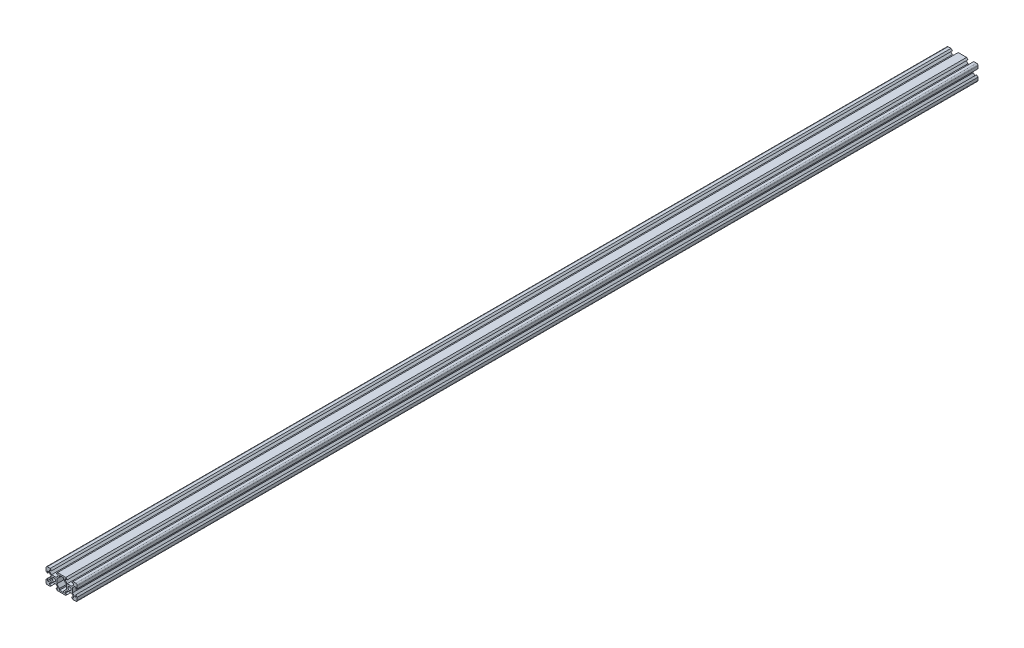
ISO-10303-21;
HEADER;
FILE_DESCRIPTION(('STEP AP214'),'2;1');
FILE_NAME('part.step','',(''),(''),'','','');
FILE_SCHEMA(('AUTOMOTIVE_DESIGN { 1 0 10303 214 1 1 1 1 }'));
ENDSEC;
DATA;
#1=APPLICATION_CONTEXT('core data for automotive mechanical design processes');
#2=APPLICATION_PROTOCOL_DEFINITION('international standard','automotive_design',2000,#1);
#3=PRODUCT_CONTEXT('',#1,'mechanical');
#4=PRODUCT('Part','Part','',(#3));
#5=PRODUCT_RELATED_PRODUCT_CATEGORY('part','',(#4));
#6=PRODUCT_DEFINITION_FORMATION('','',#4);
#7=PRODUCT_DEFINITION_CONTEXT('part definition',#1,'design');
#8=PRODUCT_DEFINITION('design','',#6,#7);
#9=PRODUCT_DEFINITION_SHAPE('','',#8);
#10=(LENGTH_UNIT() NAMED_UNIT(*) SI_UNIT(.MILLI.,.METRE.));
#11=(NAMED_UNIT(*) PLANE_ANGLE_UNIT() SI_UNIT($,.RADIAN.));
#12=(NAMED_UNIT(*) SI_UNIT($,.STERADIAN.) SOLID_ANGLE_UNIT());
#13=UNCERTAINTY_MEASURE_WITH_UNIT(LENGTH_MEASURE(1.E-05),#10,'distance_accuracy_value','');
#14=(GEOMETRIC_REPRESENTATION_CONTEXT(3) GLOBAL_UNCERTAINTY_ASSIGNED_CONTEXT((#13)) GLOBAL_UNIT_ASSIGNED_CONTEXT((#10,
#11,#12)) REPRESENTATION_CONTEXT('',''));
#15=CARTESIAN_POINT('',(0.,0.,0.));
#16=DIRECTION('',(0.,0.,1.));
#17=DIRECTION('',(1.,0.,0.));
#18=AXIS2_PLACEMENT_3D('',#15,#16,#17);
#19=CARTESIAN_POINT('',(2.69933982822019,-8.19999999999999,0.));
#20=DIRECTION('',(1.,0.,0.));
#21=DIRECTION('',(0.,0.707106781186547,0.707106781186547));
#22=AXIS2_PLACEMENT_3D('',#19,#20,#21);
#23=PLANE('',#22);
#24=DIRECTION('',(0.,0.,1.));
#25=VECTOR('',#24,1.);
#26=CARTESIAN_POINT('',(2.69933982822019,-8.19999999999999,0.));
#27=LINE('',#26,#25);
#28=CARTESIAN_POINT('',(2.69933982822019,-8.19999999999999,0.));
#29=VERTEX_POINT('',#28);
#30=CARTESIAN_POINT('',(2.69933982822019,-8.19999999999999,1153.80008));
#31=VERTEX_POINT('',#30);
#32=EDGE_CURVE('E11',#29,#31,#27,.T.);
#33=ORIENTED_EDGE('',*,*,#32,.T.);
#34=DIRECTION('',(0.,1.,0.));
#35=VECTOR('',#34,1.);
#36=CARTESIAN_POINT('',(2.69933982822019,-8.19999999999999,1153.80008));
#37=LINE('',#36,#35);
#38=CARTESIAN_POINT('',(2.69933982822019,-6.23999999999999,1153.80008));
#39=VERTEX_POINT('',#38);
#40=EDGE_CURVE('E598',#31,#39,#37,.T.);
#41=ORIENTED_EDGE('',*,*,#40,.T.);
#42=DIRECTION('',(0.,0.,1.));
#43=VECTOR('',#42,1.);
#44=CARTESIAN_POINT('',(2.69933982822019,-6.23999999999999,0.));
#45=LINE('',#44,#43);
#46=CARTESIAN_POINT('',(2.69933982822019,-6.23999999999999,0.));
#47=VERTEX_POINT('',#46);
#48=EDGE_CURVE('E47',#47,#39,#45,.T.);
#49=ORIENTED_EDGE('',*,*,#48,.F.);
#50=DIRECTION('',(0.,1.,0.));
#51=VECTOR('',#50,1.);
#52=CARTESIAN_POINT('',(2.69933982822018,-4.09999999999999,0.));
#53=LINE('',#52,#51);
#54=EDGE_CURVE('E56',#29,#47,#53,.T.);
#55=ORIENTED_EDGE('',*,*,#54,.F.);
#56=EDGE_LOOP('',(#33,#41,#49,#55));
#57=FACE_BOUND('',#56,.T.);
#58=ADVANCED_FACE('F37',(#57),#23,.F.);
#59=CARTESIAN_POINT('',(2.69933982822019,-6.23999999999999,0.));
#60=DIRECTION('',(0.707106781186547,-0.707106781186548,0.));
#61=DIRECTION('',(0.577350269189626,0.577350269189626,0.577350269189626));
#62=AXIS2_PLACEMENT_3D('',#59,#60,#61);
#63=PLANE('',#62);
#64=ORIENTED_EDGE('',*,*,#48,.T.);
#65=DIRECTION('',(0.707106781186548,0.707106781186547,0.));
#66=VECTOR('',#65,1.);
#67=CARTESIAN_POINT('',(2.69933982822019,-6.23999999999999,1153.80008));
#68=LINE('',#67,#66);
#69=CARTESIAN_POINT('',(6.09933982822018,-2.84,1153.80008));
#70=VERTEX_POINT('',#69);
#71=EDGE_CURVE('E601',#39,#70,#68,.T.);
#72=ORIENTED_EDGE('',*,*,#71,.T.);
#73=DIRECTION('',(0.,0.,1.));
#74=VECTOR('',#73,1.);
#75=CARTESIAN_POINT('',(6.09933982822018,-2.84,0.));
#76=LINE('',#75,#74);
#77=CARTESIAN_POINT('',(6.09933982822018,-2.84,0.));
#78=VERTEX_POINT('',#77);
#79=EDGE_CURVE('E822',#78,#70,#76,.T.);
#80=ORIENTED_EDGE('',*,*,#79,.F.);
#81=DIRECTION('',(0.707106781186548,0.707106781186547,0.));
#82=VECTOR('',#81,1.);
#83=CARTESIAN_POINT('',(3.58450487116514,-5.35483495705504,0.));
#84=LINE('',#83,#82);
#85=EDGE_CURVE('E824',#47,#78,#84,.T.);
#86=ORIENTED_EDGE('',*,*,#85,.F.);
#87=EDGE_LOOP('',(#64,#72,#80,#86));
#88=FACE_BOUND('',#87,.T.);
#89=ADVANCED_FACE('F1473',(#88),#63,.F.);
#90=CARTESIAN_POINT('',(6.09933982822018,-2.84,0.));
#91=DIRECTION('',(1.,0.,0.));
#92=DIRECTION('',(0.,0.707106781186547,0.707106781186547));
#93=AXIS2_PLACEMENT_3D('',#90,#91,#92);
#94=PLANE('',#93);
#95=ORIENTED_EDGE('',*,*,#79,.T.);
#96=DIRECTION('',(0.,1.,0.));
#97=VECTOR('',#96,1.);
#98=CARTESIAN_POINT('',(6.09933982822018,-2.84,1153.80008));
#99=LINE('',#98,#97);
#100=CARTESIAN_POINT('',(6.09933982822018,2.84000000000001,1153.80008));
#101=VERTEX_POINT('',#100);
#102=EDGE_CURVE('E604',#70,#101,#99,.T.);
#103=ORIENTED_EDGE('',*,*,#102,.T.);
#104=DIRECTION('',(0.,0.,1.));
#105=VECTOR('',#104,1.);
#106=CARTESIAN_POINT('',(6.09933982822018,2.84000000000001,0.));
#107=LINE('',#106,#105);
#108=CARTESIAN_POINT('',(6.09933982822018,2.84000000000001,0.));
#109=VERTEX_POINT('',#108);
#110=EDGE_CURVE('E827',#109,#101,#107,.T.);
#111=ORIENTED_EDGE('',*,*,#110,.F.);
#112=DIRECTION('',(0.,1.,0.));
#113=VECTOR('',#112,1.);
#114=CARTESIAN_POINT('',(6.09933982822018,-1.42,0.));
#115=LINE('',#114,#113);
#116=EDGE_CURVE('E829',#78,#109,#115,.T.);
#117=ORIENTED_EDGE('',*,*,#116,.F.);
#118=EDGE_LOOP('',(#95,#103,#111,#117));
#119=FACE_BOUND('',#118,.T.);
#120=ADVANCED_FACE('F1479',(#119),#94,.F.);
#121=CARTESIAN_POINT('',(6.09933982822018,2.84000000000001,0.));
#122=DIRECTION('',(0.707106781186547,0.707106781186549,0.));
#123=DIRECTION('',(-0.577350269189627,0.577350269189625,0.577350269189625));
#124=AXIS2_PLACEMENT_3D('',#121,#122,#123);
#125=PLANE('',#124);
#126=ORIENTED_EDGE('',*,*,#110,.T.);
#127=DIRECTION('',(-0.707106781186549,0.707106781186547,0.));
#128=VECTOR('',#127,1.);
#129=CARTESIAN_POINT('',(6.09933982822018,2.84000000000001,1153.80008));
#130=LINE('',#129,#128);
#131=CARTESIAN_POINT('',(2.69933982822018,6.23999999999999,1153.80008));
#132=VERTEX_POINT('',#131);
#133=EDGE_CURVE('E607',#101,#132,#130,.T.);
#134=ORIENTED_EDGE('',*,*,#133,.T.);
#135=DIRECTION('',(0.,0.,1.));
#136=VECTOR('',#135,1.);
#137=CARTESIAN_POINT('',(2.69933982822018,6.23999999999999,0.));
#138=LINE('',#137,#136);
#139=CARTESIAN_POINT('',(2.69933982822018,6.23999999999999,0.));
#140=VERTEX_POINT('',#139);
#141=EDGE_CURVE('E312',#140,#132,#138,.T.);
#142=ORIENTED_EDGE('',*,*,#141,.F.);
#143=DIRECTION('',(-0.707106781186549,0.707106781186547,0.));
#144=VECTOR('',#143,1.);
#145=CARTESIAN_POINT('',(5.28450487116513,3.65483495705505,0.));
#146=LINE('',#145,#144);
#147=EDGE_CURVE('E832',#109,#140,#146,.T.);
#148=ORIENTED_EDGE('',*,*,#147,.F.);
#149=EDGE_LOOP('',(#126,#134,#142,#148));
#150=FACE_BOUND('',#149,.T.);
#151=ADVANCED_FACE('F1486',(#150),#125,.F.);
#152=CARTESIAN_POINT('',(2.69933982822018,6.23999999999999,0.));
#153=DIRECTION('',(1.,0.,0.));
#154=DIRECTION('',(0.,0.707106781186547,0.707106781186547));
#155=AXIS2_PLACEMENT_3D('',#152,#153,#154);
#156=PLANE('',#155);
#157=ORIENTED_EDGE('',*,*,#141,.T.);
#158=DIRECTION('',(0.,1.,0.));
#159=VECTOR('',#158,1.);
#160=CARTESIAN_POINT('',(2.69933982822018,6.23999999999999,1153.80008));
#161=LINE('',#160,#159);
#162=CARTESIAN_POINT('',(2.69933982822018,8.2,1153.80008));
#163=VERTEX_POINT('',#162);
#164=EDGE_CURVE('E609',#132,#163,#161,.T.);
#165=ORIENTED_EDGE('',*,*,#164,.T.);
#166=DIRECTION('',(0.,0.,1.));
#167=VECTOR('',#166,1.);
#168=CARTESIAN_POINT('',(2.69933982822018,8.2,0.));
#169=LINE('',#168,#167);
#170=CARTESIAN_POINT('',(2.69933982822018,8.2,0.));
#171=VERTEX_POINT('',#170);
#172=EDGE_CURVE('E575',#171,#163,#169,.T.);
#173=ORIENTED_EDGE('',*,*,#172,.F.);
#174=DIRECTION('',(0.,1.,0.));
#175=VECTOR('',#174,1.);
#176=CARTESIAN_POINT('',(2.69933982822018,3.12,0.));
#177=LINE('',#176,#175);
#178=EDGE_CURVE('E835',#140,#171,#177,.T.);
#179=ORIENTED_EDGE('',*,*,#178,.F.);
#180=EDGE_LOOP('',(#157,#165,#173,#179));
#181=FACE_BOUND('',#180,.T.);
#182=ADVANCED_FACE('F1490',(#181),#156,.F.);
#183=CARTESIAN_POINT('',(2.69933982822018,8.2,0.));
#184=DIRECTION('',(0.,1.,0.));
#185=DIRECTION('',(0.707106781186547,0.,0.707106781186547));
#186=AXIS2_PLACEMENT_3D('',#183,#184,#185);
#187=PLANE('',#186);
#188=ORIENTED_EDGE('',*,*,#172,.T.);
#189=DIRECTION('',(-1.,0.,0.));
#190=VECTOR('',#189,1.);
#191=CARTESIAN_POINT('',(2.69933982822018,8.2,1153.80008));
#192=LINE('',#191,#190);
#193=CARTESIAN_POINT('',(-2.69933982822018,8.2,1153.80008));
#194=VERTEX_POINT('',#193);
#195=EDGE_CURVE('E572',#163,#194,#192,.T.);
#196=ORIENTED_EDGE('',*,*,#195,.T.);
#197=DIRECTION('',(0.,0.,1.));
#198=VECTOR('',#197,1.);
#199=CARTESIAN_POINT('',(-2.69933982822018,8.2,0.));
#200=LINE('',#199,#198);
#201=CARTESIAN_POINT('',(-2.69933982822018,8.2,0.));
#202=VERTEX_POINT('',#201);
#203=EDGE_CURVE('E558',#202,#194,#200,.T.);
#204=ORIENTED_EDGE('',*,*,#203,.F.);
#205=DIRECTION('',(-1.,0.,0.));
#206=VECTOR('',#205,1.);
#207=CARTESIAN_POINT('',(1.34966991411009,8.2,0.));
#208=LINE('',#207,#206);
#209=EDGE_CURVE('E838',#171,#202,#208,.T.);
#210=ORIENTED_EDGE('',*,*,#209,.F.);
#211=EDGE_LOOP('',(#188,#196,#204,#210));
#212=FACE_BOUND('',#211,.T.);
#213=ADVANCED_FACE('F573',(#212),#187,.F.);
#214=CARTESIAN_POINT('',(15.4993398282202,8.20000000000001,0.));
#215=DIRECTION('',(-1.,0.,0.));
#216=DIRECTION('',(0.,0.707106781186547,0.707106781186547));
#217=AXIS2_PLACEMENT_3D('',#214,#215,#216);
#218=PLANE('',#217);
#219=DIRECTION('',(0.,0.,1.));
#220=VECTOR('',#219,1.);
#221=CARTESIAN_POINT('',(15.4993398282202,6.56000000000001,0.));
#222=LINE('',#221,#220);
#223=CARTESIAN_POINT('',(15.4993398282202,6.56000000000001,0.));
#224=VERTEX_POINT('',#223);
#225=CARTESIAN_POINT('',(15.4993398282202,6.56000000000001,1153.80008));
#226=VERTEX_POINT('',#225);
#227=EDGE_CURVE('E837',#224,#226,#222,.T.);
#228=ORIENTED_EDGE('',*,*,#227,.T.);
#229=DIRECTION('',(0.,-1.,0.));
#230=VECTOR('',#229,1.);
#231=CARTESIAN_POINT('',(15.4993398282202,8.20000000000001,1153.80008));
#232=LINE('',#231,#230);
#233=CARTESIAN_POINT('',(15.4993398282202,8.20000000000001,1153.80008));
#234=VERTEX_POINT('',#233);
#235=EDGE_CURVE('E722',#234,#226,#232,.T.);
#236=ORIENTED_EDGE('',*,*,#235,.F.);
#237=DIRECTION('',(0.,0.,1.));
#238=VECTOR('',#237,1.);
#239=CARTESIAN_POINT('',(15.4993398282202,8.20000000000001,0.));
#240=LINE('',#239,#238);
#241=CARTESIAN_POINT('',(15.4993398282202,8.20000000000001,0.));
#242=VERTEX_POINT('',#241);
#243=EDGE_CURVE('E842',#242,#234,#240,.T.);
#244=ORIENTED_EDGE('',*,*,#243,.F.);
#245=DIRECTION('',(0.,1.,0.));
#246=VECTOR('',#245,1.);
#247=CARTESIAN_POINT('',(15.4993398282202,4.09999999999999,0.));
#248=LINE('',#247,#246);
#249=EDGE_CURVE('E845',#224,#242,#248,.T.);
#250=ORIENTED_EDGE('',*,*,#249,.F.);
#251=EDGE_LOOP('',(#228,#236,#244,#250));
#252=FACE_BOUND('',#251,.T.);
#253=ADVANCED_FACE('F1140',(#252),#218,.T.);
#254=CARTESIAN_POINT('',(12.84,8.2,0.));
#255=DIRECTION('',(0.,-1.,0.));
#256=DIRECTION('',(0.707106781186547,0.,0.707106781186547));
#257=AXIS2_PLACEMENT_3D('',#254,#255,#256);
#258=PLANE('',#257);
#259=ORIENTED_EDGE('',*,*,#243,.T.);
#260=DIRECTION('',(1.,0.,0.));
#261=VECTOR('',#260,1.);
#262=CARTESIAN_POINT('',(12.84,8.2,1153.80008));
#263=LINE('',#262,#261);
#264=CARTESIAN_POINT('',(12.84,8.2,1153.80008));
#265=VERTEX_POINT('',#264);
#266=EDGE_CURVE('E719',#265,#234,#263,.T.);
#267=ORIENTED_EDGE('',*,*,#266,.F.);
#268=DIRECTION('',(0.,0.,1.));
#269=VECTOR('',#268,1.);
#270=CARTESIAN_POINT('',(12.84,8.2,0.));
#271=LINE('',#270,#269);
#272=CARTESIAN_POINT('',(12.84,8.2,0.));
#273=VERTEX_POINT('',#272);
#274=EDGE_CURVE('E844',#273,#265,#271,.T.);
#275=ORIENTED_EDGE('',*,*,#274,.F.);
#276=DIRECTION('',(-1.,0.,0.));
#277=VECTOR('',#276,1.);
#278=CARTESIAN_POINT('',(6.41999999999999,8.19999999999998,0.));
#279=LINE('',#278,#277);
#280=EDGE_CURVE('E847',#242,#273,#279,.T.);
#281=ORIENTED_EDGE('',*,*,#280,.F.);
#282=EDGE_LOOP('',(#259,#267,#275,#281));
#283=FACE_BOUND('',#282,.T.);
#284=ADVANCED_FACE('F1148',(#283),#258,.T.);
#285=CARTESIAN_POINT('',(14.64,10.,0.));
#286=DIRECTION('',(-0.707106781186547,0.707106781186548,0.));
#287=DIRECTION('',(0.577350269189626,0.577350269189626,0.577350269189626));
#288=AXIS2_PLACEMENT_3D('',#285,#286,#287);
#289=PLANE('',#288);
#290=ORIENTED_EDGE('',*,*,#274,.T.);
#291=DIRECTION('',(-0.707106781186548,-0.707106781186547,0.));
#292=VECTOR('',#291,1.);
#293=CARTESIAN_POINT('',(14.64,10.,1153.80008));
#294=LINE('',#293,#292);
#295=CARTESIAN_POINT('',(14.64,10.,1153.80008));
#296=VERTEX_POINT('',#295);
#297=EDGE_CURVE('E716',#296,#265,#294,.T.);
#298=ORIENTED_EDGE('',*,*,#297,.F.);
#299=DIRECTION('',(0.,0.,1.));
#300=VECTOR('',#299,1.);
#301=CARTESIAN_POINT('',(14.64,10.,0.));
#302=LINE('',#301,#300);
#303=CARTESIAN_POINT('',(14.64,10.,0.));
#304=VERTEX_POINT('',#303);
#305=EDGE_CURVE('E850',#304,#296,#302,.T.);
#306=ORIENTED_EDGE('',*,*,#305,.F.);
#307=DIRECTION('',(0.707106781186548,0.707106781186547,0.));
#308=VECTOR('',#307,1.);
#309=CARTESIAN_POINT('',(8.48,3.84,0.));
#310=LINE('',#309,#308);
#311=EDGE_CURVE('E852',#273,#304,#310,.T.);
#312=ORIENTED_EDGE('',*,*,#311,.F.);
#313=EDGE_LOOP('',(#290,#298,#306,#312));
#314=FACE_BOUND('',#313,.T.);
#315=ADVANCED_FACE('F1155',(#314),#289,.T.);
#316=CARTESIAN_POINT('',(18.2,10.,0.));
#317=DIRECTION('',(0.,1.,0.));
#318=DIRECTION('',(0.707106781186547,0.,0.707106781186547));
#319=AXIS2_PLACEMENT_3D('',#316,#317,#318);
#320=PLANE('',#319);
#321=ORIENTED_EDGE('',*,*,#305,.T.);
#322=DIRECTION('',(-1.,0.,0.));
#323=VECTOR('',#322,1.);
#324=CARTESIAN_POINT('',(18.2,10.,1153.80008));
#325=LINE('',#324,#323);
#326=CARTESIAN_POINT('',(18.2,10.,1153.80008));
#327=VERTEX_POINT('',#326);
#328=EDGE_CURVE('E713',#327,#296,#325,.T.);
#329=ORIENTED_EDGE('',*,*,#328,.F.);
#330=DIRECTION('',(0.,0.,1.));
#331=VECTOR('',#330,1.);
#332=CARTESIAN_POINT('',(18.2,10.,0.));
#333=LINE('',#332,#331);
#334=CARTESIAN_POINT('',(18.2,10.,0.));
#335=VERTEX_POINT('',#334);
#336=EDGE_CURVE('E854',#335,#327,#333,.T.);
#337=ORIENTED_EDGE('',*,*,#336,.F.);
#338=DIRECTION('',(1.,0.,0.));
#339=VECTOR('',#338,1.);
#340=CARTESIAN_POINT('',(9.09999999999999,9.99999999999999,0.));
#341=LINE('',#340,#339);
#342=EDGE_CURVE('E856',#304,#335,#341,.T.);
#343=ORIENTED_EDGE('',*,*,#342,.F.);
#344=EDGE_LOOP('',(#321,#329,#337,#343));
#345=FACE_BOUND('',#344,.T.);
#346=ADVANCED_FACE('F1158',(#345),#320,.T.);
#347=CARTESIAN_POINT('',(18.2,8.2,0.));
#348=DIRECTION('',(0.,0.,1.));
#349=DIRECTION('',(-1.,0.,0.));
#350=AXIS2_PLACEMENT_3D('',#347,#348,#349);
#351=CYLINDRICAL_SURFACE('',#350,1.8);
#352=ORIENTED_EDGE('',*,*,#336,.T.);
#353=CARTESIAN_POINT('',(18.2,8.2,1153.80008));
#354=DIRECTION('',(0.,0.,1.));
#355=DIRECTION('',(1.,0.,0.));
#356=AXIS2_PLACEMENT_3D('',#353,#354,#355);
#357=CIRCLE('',#356,1.8);
#358=CARTESIAN_POINT('',(20.,8.2,1153.80008));
#359=VERTEX_POINT('',#358);
#360=EDGE_CURVE('E710',#359,#327,#357,.T.);
#361=ORIENTED_EDGE('',*,*,#360,.F.);
#362=DIRECTION('',(0.,0.,1.));
#363=VECTOR('',#362,1.);
#364=CARTESIAN_POINT('',(20.,8.2,0.));
#365=LINE('',#364,#363);
#366=CARTESIAN_POINT('',(20.,8.2,0.));
#367=VERTEX_POINT('',#366);
#368=EDGE_CURVE('E858',#367,#359,#365,.T.);
#369=ORIENTED_EDGE('',*,*,#368,.F.);
#370=CARTESIAN_POINT('',(18.2,8.2,0.));
#371=DIRECTION('',(0.,0.,-1.));
#372=DIRECTION('',(-1.,0.,0.));
#373=AXIS2_PLACEMENT_3D('',#370,#371,#372);
#374=CIRCLE('',#373,1.8);
#375=EDGE_CURVE('E860',#335,#367,#374,.T.);
#376=ORIENTED_EDGE('',*,*,#375,.F.);
#377=EDGE_LOOP('',(#352,#361,#369,#376));
#378=FACE_BOUND('',#377,.T.);
#379=ADVANCED_FACE('F1163',(#378),#351,.T.);
#380=CARTESIAN_POINT('',(20.,4.64,0.));
#381=DIRECTION('',(1.,0.,0.));
#382=DIRECTION('',(0.,0.707106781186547,0.707106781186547));
#383=AXIS2_PLACEMENT_3D('',#380,#381,#382);
#384=PLANE('',#383);
#385=ORIENTED_EDGE('',*,*,#368,.T.);
#386=DIRECTION('',(0.,1.,0.));
#387=VECTOR('',#386,1.);
#388=CARTESIAN_POINT('',(20.,4.64,1153.80008));
#389=LINE('',#388,#387);
#390=CARTESIAN_POINT('',(20.,4.64,1153.80008));
#391=VERTEX_POINT('',#390);
#392=EDGE_CURVE('E707',#391,#359,#389,.T.);
#393=ORIENTED_EDGE('',*,*,#392,.F.);
#394=DIRECTION('',(0.,0.,1.));
#395=VECTOR('',#394,1.);
#396=CARTESIAN_POINT('',(20.,4.64,0.));
#397=LINE('',#396,#395);
#398=CARTESIAN_POINT('',(20.,4.64,0.));
#399=VERTEX_POINT('',#398);
#400=EDGE_CURVE('E862',#399,#391,#397,.T.);
#401=ORIENTED_EDGE('',*,*,#400,.F.);
#402=DIRECTION('',(0.,-1.,0.));
#403=VECTOR('',#402,1.);
#404=CARTESIAN_POINT('',(20.,2.31999999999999,0.));
#405=LINE('',#404,#403);
#406=EDGE_CURVE('E864',#367,#399,#405,.T.);
#407=ORIENTED_EDGE('',*,*,#406,.F.);
#408=EDGE_LOOP('',(#385,#393,#401,#407));
#409=FACE_BOUND('',#408,.T.);
#410=ADVANCED_FACE('F1170',(#409),#384,.T.);
#411=CARTESIAN_POINT('',(18.2,2.84,0.));
#412=DIRECTION('',(0.707106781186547,-0.707106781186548,0.));
#413=DIRECTION('',(0.577350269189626,0.577350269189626,0.577350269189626));
#414=AXIS2_PLACEMENT_3D('',#411,#412,#413);
#415=PLANE('',#414);
#416=ORIENTED_EDGE('',*,*,#400,.T.);
#417=DIRECTION('',(0.707106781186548,0.707106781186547,0.));
#418=VECTOR('',#417,1.);
#419=CARTESIAN_POINT('',(18.2,2.84,1153.80008));
#420=LINE('',#419,#418);
#421=CARTESIAN_POINT('',(18.2,2.84,1153.80008));
#422=VERTEX_POINT('',#421);
#423=EDGE_CURVE('E704',#422,#391,#420,.T.);
#424=ORIENTED_EDGE('',*,*,#423,.F.);
#425=DIRECTION('',(0.,0.,1.));
#426=VECTOR('',#425,1.);
#427=CARTESIAN_POINT('',(18.2,2.84,0.));
#428=LINE('',#427,#426);
#429=CARTESIAN_POINT('',(18.2,2.84,0.));
#430=VERTEX_POINT('',#429);
#431=EDGE_CURVE('E866',#430,#422,#428,.T.);
#432=ORIENTED_EDGE('',*,*,#431,.F.);
#433=DIRECTION('',(-0.707106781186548,-0.707106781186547,0.));
#434=VECTOR('',#433,1.);
#435=CARTESIAN_POINT('',(12.94,-2.42,0.));
#436=LINE('',#435,#434);
#437=EDGE_CURVE('E868',#399,#430,#436,.T.);
#438=ORIENTED_EDGE('',*,*,#437,.F.);
#439=EDGE_LOOP('',(#416,#424,#432,#438));
#440=FACE_BOUND('',#439,.T.);
#441=ADVANCED_FACE('F1173',(#440),#415,.T.);
#442=CARTESIAN_POINT('',(18.2,5.49933982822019,0.));
#443=DIRECTION('',(-1.,0.,0.));
#444=DIRECTION('',(0.,0.707106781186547,0.707106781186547));
#445=AXIS2_PLACEMENT_3D('',#442,#443,#444);
#446=PLANE('',#445);
#447=ORIENTED_EDGE('',*,*,#431,.T.);
#448=DIRECTION('',(0.,-1.,0.));
#449=VECTOR('',#448,1.);
#450=CARTESIAN_POINT('',(18.2,5.49933982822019,1153.80008));
#451=LINE('',#450,#449);
#452=CARTESIAN_POINT('',(18.2,5.49933982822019,1153.80008));
#453=VERTEX_POINT('',#452);
#454=EDGE_CURVE('E701',#453,#422,#451,.T.);
#455=ORIENTED_EDGE('',*,*,#454,.F.);
#456=DIRECTION('',(0.,0.,1.));
#457=VECTOR('',#456,1.);
#458=CARTESIAN_POINT('',(18.2,5.49933982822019,0.));
#459=LINE('',#458,#457);
#460=CARTESIAN_POINT('',(18.2,5.49933982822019,0.));
#461=VERTEX_POINT('',#460);
#462=EDGE_CURVE('E870',#461,#453,#459,.T.);
#463=ORIENTED_EDGE('',*,*,#462,.F.);
#464=DIRECTION('',(0.,1.,0.));
#465=VECTOR('',#464,1.);
#466=CARTESIAN_POINT('',(18.2,2.74966991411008,0.));
#467=LINE('',#466,#465);
#468=EDGE_CURVE('E872',#430,#461,#467,.T.);
#469=ORIENTED_EDGE('',*,*,#468,.F.);
#470=EDGE_LOOP('',(#447,#455,#463,#469));
#471=FACE_BOUND('',#470,.T.);
#472=ADVANCED_FACE('F1178',(#471),#446,.T.);
#473=CARTESIAN_POINT('',(16.56,5.49933982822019,0.));
#474=DIRECTION('',(0.,-1.,0.));
#475=DIRECTION('',(0.707106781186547,0.,0.707106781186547));
#476=AXIS2_PLACEMENT_3D('',#473,#474,#475);
#477=PLANE('',#476);
#478=ORIENTED_EDGE('',*,*,#462,.T.);
#479=DIRECTION('',(1.,0.,0.));
#480=VECTOR('',#479,1.);
#481=CARTESIAN_POINT('',(16.56,5.49933982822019,1153.80008));
#482=LINE('',#481,#480);
#483=CARTESIAN_POINT('',(16.56,5.49933982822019,1153.80008));
#484=VERTEX_POINT('',#483);
#485=EDGE_CURVE('E698',#484,#453,#482,.T.);
#486=ORIENTED_EDGE('',*,*,#485,.F.);
#487=DIRECTION('',(0.,0.,1.));
#488=VECTOR('',#487,1.);
#489=CARTESIAN_POINT('',(16.56,5.49933982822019,0.));
#490=LINE('',#489,#488);
#491=CARTESIAN_POINT('',(16.56,5.49933982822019,0.));
#492=VERTEX_POINT('',#491);
#493=EDGE_CURVE('E874',#492,#484,#490,.T.);
#494=ORIENTED_EDGE('',*,*,#493,.F.);
#495=DIRECTION('',(-1.,0.,0.));
#496=VECTOR('',#495,1.);
#497=CARTESIAN_POINT('',(8.28,5.49933982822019,0.));
#498=LINE('',#497,#496);
#499=EDGE_CURVE('E876',#461,#492,#498,.T.);
#500=ORIENTED_EDGE('',*,*,#499,.F.);
#501=EDGE_LOOP('',(#478,#486,#494,#500));
#502=FACE_BOUND('',#501,.T.);
#503=ADVANCED_FACE('F1185',(#502),#477,.T.);
#504=CARTESIAN_POINT('',(13.9006601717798,2.84,0.));
#505=DIRECTION('',(0.707106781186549,-0.707106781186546,0.));
#506=DIRECTION('',(0.577350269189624,0.577350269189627,0.577350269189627));
#507=AXIS2_PLACEMENT_3D('',#504,#505,#506);
#508=PLANE('',#507);
#509=ORIENTED_EDGE('',*,*,#493,.T.);
#510=DIRECTION('',(0.707106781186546,0.707106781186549,0.));
#511=VECTOR('',#510,1.);
#512=CARTESIAN_POINT('',(13.9006601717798,2.84,1153.80008));
#513=LINE('',#512,#511);
#514=CARTESIAN_POINT('',(13.9006601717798,2.84,1153.80008));
#515=VERTEX_POINT('',#514);
#516=EDGE_CURVE('E695',#515,#484,#513,.T.);
#517=ORIENTED_EDGE('',*,*,#516,.F.);
#518=DIRECTION('',(0.,0.,1.));
#519=VECTOR('',#518,1.);
#520=CARTESIAN_POINT('',(13.9006601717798,2.84,0.));
#521=LINE('',#520,#519);
#522=CARTESIAN_POINT('',(13.9006601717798,2.84,0.));
#523=VERTEX_POINT('',#522);
#524=EDGE_CURVE('E878',#523,#515,#521,.T.);
#525=ORIENTED_EDGE('',*,*,#524,.F.);
#526=DIRECTION('',(-0.707106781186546,-0.707106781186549,0.));
#527=VECTOR('',#526,1.);
#528=CARTESIAN_POINT('',(9.71549512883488,-1.34516504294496,0.));
#529=LINE('',#528,#527);
#530=EDGE_CURVE('E880',#492,#523,#529,.T.);
#531=ORIENTED_EDGE('',*,*,#530,.F.);
#532=EDGE_LOOP('',(#509,#517,#525,#531));
#533=FACE_BOUND('',#532,.T.);
#534=ADVANCED_FACE('F1188',(#533),#508,.T.);
#535=CARTESIAN_POINT('',(13.9006601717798,-2.84,0.));
#536=DIRECTION('',(1.,0.,0.));
#537=DIRECTION('',(0.,0.707106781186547,0.707106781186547));
#538=AXIS2_PLACEMENT_3D('',#535,#536,#537);
#539=PLANE('',#538);
#540=ORIENTED_EDGE('',*,*,#524,.T.);
#541=DIRECTION('',(0.,1.,0.));
#542=VECTOR('',#541,1.);
#543=CARTESIAN_POINT('',(13.9006601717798,-2.84,1153.80008));
#544=LINE('',#543,#542);
#545=CARTESIAN_POINT('',(13.9006601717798,-2.84,1153.80008));
#546=VERTEX_POINT('',#545);
#547=EDGE_CURVE('E692',#546,#515,#544,.T.);
#548=ORIENTED_EDGE('',*,*,#547,.F.);
#549=DIRECTION('',(0.,0.,1.));
#550=VECTOR('',#549,1.);
#551=CARTESIAN_POINT('',(13.9006601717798,-2.84,0.));
#552=LINE('',#551,#550);
#553=CARTESIAN_POINT('',(13.9006601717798,-2.84,0.));
#554=VERTEX_POINT('',#553);
#555=EDGE_CURVE('E882',#554,#546,#552,.T.);
#556=ORIENTED_EDGE('',*,*,#555,.F.);
#557=DIRECTION('',(0.,-1.,0.));
#558=VECTOR('',#557,1.);
#559=CARTESIAN_POINT('',(13.9006601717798,-1.42,0.));
#560=LINE('',#559,#558);
#561=EDGE_CURVE('E884',#523,#554,#560,.T.);
#562=ORIENTED_EDGE('',*,*,#561,.F.);
#563=EDGE_LOOP('',(#540,#548,#556,#562));
#564=FACE_BOUND('',#563,.T.);
#565=ADVANCED_FACE('F1193',(#564),#539,.T.);
#566=CARTESIAN_POINT('',(16.56,-5.49933982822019,0.));
#567=DIRECTION('',(0.707106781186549,0.707106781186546,0.));
#568=DIRECTION('',(-0.577350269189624,0.577350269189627,0.577350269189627));
#569=AXIS2_PLACEMENT_3D('',#566,#567,#568);
#570=PLANE('',#569);
#571=ORIENTED_EDGE('',*,*,#555,.T.);
#572=DIRECTION('',(-0.707106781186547,0.707106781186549,0.));
#573=VECTOR('',#572,1.);
#574=CARTESIAN_POINT('',(16.56,-5.49933982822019,1153.80008));
#575=LINE('',#574,#573);
#576=CARTESIAN_POINT('',(16.56,-5.49933982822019,1153.80008));
#577=VERTEX_POINT('',#576);
#578=EDGE_CURVE('E689',#577,#546,#575,.T.);
#579=ORIENTED_EDGE('',*,*,#578,.F.);
#580=DIRECTION('',(0.,0.,1.));
#581=VECTOR('',#580,1.);
#582=CARTESIAN_POINT('',(16.56,-5.49933982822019,0.));
#583=LINE('',#582,#581);
#584=CARTESIAN_POINT('',(16.56,-5.49933982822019,0.));
#585=VERTEX_POINT('',#584);
#586=EDGE_CURVE('E886',#585,#577,#583,.T.);
#587=ORIENTED_EDGE('',*,*,#586,.F.);
#588=DIRECTION('',(0.707106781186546,-0.707106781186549,0.));
#589=VECTOR('',#588,1.);
#590=CARTESIAN_POINT('',(11.045165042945,0.0154951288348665,0.));
#591=LINE('',#590,#589);
#592=EDGE_CURVE('E888',#554,#585,#591,.T.);
#593=ORIENTED_EDGE('',*,*,#592,.F.);
#594=EDGE_LOOP('',(#571,#579,#587,#593));
#595=FACE_BOUND('',#594,.T.);
#596=ADVANCED_FACE('F1200',(#595),#570,.T.);
#597=CARTESIAN_POINT('',(18.2,-5.49933982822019,0.));
#598=DIRECTION('',(0.,1.,0.));
#599=DIRECTION('',(0.707106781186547,0.,0.707106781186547));
#600=AXIS2_PLACEMENT_3D('',#597,#598,#599);
#601=PLANE('',#600);
#602=ORIENTED_EDGE('',*,*,#586,.T.);
#603=DIRECTION('',(-1.,0.,0.));
#604=VECTOR('',#603,1.);
#605=CARTESIAN_POINT('',(18.2,-5.49933982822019,1153.80008));
#606=LINE('',#605,#604);
#607=CARTESIAN_POINT('',(18.2,-5.49933982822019,1153.80008));
#608=VERTEX_POINT('',#607);
#609=EDGE_CURVE('E686',#608,#577,#606,.T.);
#610=ORIENTED_EDGE('',*,*,#609,.F.);
#611=DIRECTION('',(0.,0.,1.));
#612=VECTOR('',#611,1.);
#613=CARTESIAN_POINT('',(18.2,-5.49933982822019,0.));
#614=LINE('',#613,#612);
#615=CARTESIAN_POINT('',(18.2,-5.49933982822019,0.));
#616=VERTEX_POINT('',#615);
#617=EDGE_CURVE('E890',#616,#608,#614,.T.);
#618=ORIENTED_EDGE('',*,*,#617,.F.);
#619=DIRECTION('',(1.,0.,0.));
#620=VECTOR('',#619,1.);
#621=CARTESIAN_POINT('',(9.1,-5.49933982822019,0.));
#622=LINE('',#621,#620);
#623=EDGE_CURVE('E892',#585,#616,#622,.T.);
#624=ORIENTED_EDGE('',*,*,#623,.F.);
#625=EDGE_LOOP('',(#602,#610,#618,#624));
#626=FACE_BOUND('',#625,.T.);
#627=ADVANCED_FACE('F1203',(#626),#601,.T.);
#628=CARTESIAN_POINT('',(18.2,-2.84,0.));
#629=DIRECTION('',(-1.,0.,0.));
#630=DIRECTION('',(0.,0.707106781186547,0.707106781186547));
#631=AXIS2_PLACEMENT_3D('',#628,#629,#630);
#632=PLANE('',#631);
#633=ORIENTED_EDGE('',*,*,#617,.T.);
#634=DIRECTION('',(0.,-1.,0.));
#635=VECTOR('',#634,1.);
#636=CARTESIAN_POINT('',(18.2,-2.84,1153.80008));
#637=LINE('',#636,#635);
#638=CARTESIAN_POINT('',(18.2,-2.84,1153.80008));
#639=VERTEX_POINT('',#638);
#640=EDGE_CURVE('E683',#639,#608,#637,.T.);
#641=ORIENTED_EDGE('',*,*,#640,.F.);
#642=DIRECTION('',(0.,0.,1.));
#643=VECTOR('',#642,1.);
#644=CARTESIAN_POINT('',(18.2,-2.84,0.));
#645=LINE('',#644,#643);
#646=CARTESIAN_POINT('',(18.2,-2.84,0.));
#647=VERTEX_POINT('',#646);
#648=EDGE_CURVE('E894',#647,#639,#645,.T.);
#649=ORIENTED_EDGE('',*,*,#648,.F.);
#650=DIRECTION('',(0.,1.,0.));
#651=VECTOR('',#650,1.);
#652=CARTESIAN_POINT('',(18.2,-1.41999999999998,0.));
#653=LINE('',#652,#651);
#654=EDGE_CURVE('E896',#616,#647,#653,.T.);
#655=ORIENTED_EDGE('',*,*,#654,.F.);
#656=EDGE_LOOP('',(#633,#641,#649,#655));
#657=FACE_BOUND('',#656,.T.);
#658=ADVANCED_FACE('F1208',(#657),#632,.T.);
#659=CARTESIAN_POINT('',(20.,-4.64,0.));
#660=DIRECTION('',(0.707106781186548,0.707106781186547,0.));
#661=DIRECTION('',(-0.577350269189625,0.577350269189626,0.577350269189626));
#662=AXIS2_PLACEMENT_3D('',#659,#660,#661);
#663=PLANE('',#662);
#664=ORIENTED_EDGE('',*,*,#648,.T.);
#665=DIRECTION('',(-0.707106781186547,0.707106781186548,0.));
#666=VECTOR('',#665,1.);
#667=CARTESIAN_POINT('',(20.,-4.64,1153.80008));
#668=LINE('',#667,#666);
#669=CARTESIAN_POINT('',(20.,-4.64,1153.80008));
#670=VERTEX_POINT('',#669);
#671=EDGE_CURVE('E680',#670,#639,#668,.T.);
#672=ORIENTED_EDGE('',*,*,#671,.F.);
#673=DIRECTION('',(0.,0.,1.));
#674=VECTOR('',#673,1.);
#675=CARTESIAN_POINT('',(20.,-4.64,0.));
#676=LINE('',#675,#674);
#677=CARTESIAN_POINT('',(20.,-4.64,0.));
#678=VERTEX_POINT('',#677);
#679=EDGE_CURVE('E898',#678,#670,#676,.T.);
#680=ORIENTED_EDGE('',*,*,#679,.F.);
#681=DIRECTION('',(0.707106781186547,-0.707106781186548,0.));
#682=VECTOR('',#681,1.);
#683=CARTESIAN_POINT('',(13.84,1.52,0.));
#684=LINE('',#683,#682);
#685=EDGE_CURVE('E900',#647,#678,#684,.T.);
#686=ORIENTED_EDGE('',*,*,#685,.F.);
#687=EDGE_LOOP('',(#664,#672,#680,#686));
#688=FACE_BOUND('',#687,.T.);
#689=ADVANCED_FACE('F1215',(#688),#663,.T.);
#690=CARTESIAN_POINT('',(20.,-8.2,0.));
#691=DIRECTION('',(1.,0.,0.));
#692=DIRECTION('',(0.,0.707106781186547,0.707106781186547));
#693=AXIS2_PLACEMENT_3D('',#690,#691,#692);
#694=PLANE('',#693);
#695=ORIENTED_EDGE('',*,*,#679,.T.);
#696=DIRECTION('',(0.,1.,0.));
#697=VECTOR('',#696,1.);
#698=CARTESIAN_POINT('',(20.,-8.2,1153.80008));
#699=LINE('',#698,#697);
#700=CARTESIAN_POINT('',(20.,-8.2,1153.80008));
#701=VERTEX_POINT('',#700);
#702=EDGE_CURVE('E677',#701,#670,#699,.T.);
#703=ORIENTED_EDGE('',*,*,#702,.F.);
#704=DIRECTION('',(0.,0.,1.));
#705=VECTOR('',#704,1.);
#706=CARTESIAN_POINT('',(20.,-8.2,0.));
#707=LINE('',#706,#705);
#708=CARTESIAN_POINT('',(20.,-8.2,0.));
#709=VERTEX_POINT('',#708);
#710=EDGE_CURVE('E902',#709,#701,#707,.T.);
#711=ORIENTED_EDGE('',*,*,#710,.F.);
#712=DIRECTION('',(0.,-1.,0.));
#713=VECTOR('',#712,1.);
#714=CARTESIAN_POINT('',(20.,-4.09999999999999,0.));
#715=LINE('',#714,#713);
#716=EDGE_CURVE('E904',#678,#709,#715,.T.);
#717=ORIENTED_EDGE('',*,*,#716,.F.);
#718=EDGE_LOOP('',(#695,#703,#711,#717));
#719=FACE_BOUND('',#718,.T.);
#720=ADVANCED_FACE('F1218',(#719),#694,.T.);
#721=CARTESIAN_POINT('',(18.2,-8.20000000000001,0.));
#722=DIRECTION('',(0.,0.,1.));
#723=DIRECTION('',(0.,1.,0.));
#724=AXIS2_PLACEMENT_3D('',#721,#722,#723);
#725=CYLINDRICAL_SURFACE('',#724,1.79999999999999);
#726=ORIENTED_EDGE('',*,*,#710,.T.);
#727=CARTESIAN_POINT('',(18.2,-8.20000000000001,1153.80008));
#728=DIRECTION('',(0.,0.,1.));
#729=DIRECTION('',(1.,0.,0.));
#730=AXIS2_PLACEMENT_3D('',#727,#728,#729);
#731=CIRCLE('',#730,1.8);
#732=CARTESIAN_POINT('',(18.2,-10.,1153.80008));
#733=VERTEX_POINT('',#732);
#734=EDGE_CURVE('E674',#733,#701,#731,.T.);
#735=ORIENTED_EDGE('',*,*,#734,.F.);
#736=DIRECTION('',(0.,0.,1.));
#737=VECTOR('',#736,1.);
#738=CARTESIAN_POINT('',(18.2,-10.,0.));
#739=LINE('',#738,#737);
#740=CARTESIAN_POINT('',(18.2,-10.,0.));
#741=VERTEX_POINT('',#740);
#742=EDGE_CURVE('E906',#741,#733,#739,.T.);
#743=ORIENTED_EDGE('',*,*,#742,.F.);
#744=CARTESIAN_POINT('',(18.2,-8.20000000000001,0.));
#745=DIRECTION('',(0.,0.,-1.));
#746=DIRECTION('',(0.,1.,0.));
#747=AXIS2_PLACEMENT_3D('',#744,#745,#746);
#748=CIRCLE('',#747,1.79999999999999);
#749=EDGE_CURVE('E908',#709,#741,#748,.T.);
#750=ORIENTED_EDGE('',*,*,#749,.F.);
#751=EDGE_LOOP('',(#726,#735,#743,#750));
#752=FACE_BOUND('',#751,.T.);
#753=ADVANCED_FACE('F1223',(#752),#725,.T.);
#754=CARTESIAN_POINT('',(14.64,-10.,0.));
#755=DIRECTION('',(0.,-1.,0.));
#756=DIRECTION('',(0.707106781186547,0.,0.707106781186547));
#757=AXIS2_PLACEMENT_3D('',#754,#755,#756);
#758=PLANE('',#757);
#759=ORIENTED_EDGE('',*,*,#742,.T.);
#760=DIRECTION('',(1.,0.,0.));
#761=VECTOR('',#760,1.);
#762=CARTESIAN_POINT('',(14.64,-10.,1153.80008));
#763=LINE('',#762,#761);
#764=CARTESIAN_POINT('',(14.64,-10.,1153.80008));
#765=VERTEX_POINT('',#764);
#766=EDGE_CURVE('E671',#765,#733,#763,.T.);
#767=ORIENTED_EDGE('',*,*,#766,.F.);
#768=DIRECTION('',(0.,0.,1.));
#769=VECTOR('',#768,1.);
#770=CARTESIAN_POINT('',(14.64,-10.,0.));
#771=LINE('',#770,#769);
#772=CARTESIAN_POINT('',(14.64,-10.,0.));
#773=VERTEX_POINT('',#772);
#774=EDGE_CURVE('E910',#773,#765,#771,.T.);
#775=ORIENTED_EDGE('',*,*,#774,.F.);
#776=DIRECTION('',(-1.,0.,0.));
#777=VECTOR('',#776,1.);
#778=CARTESIAN_POINT('',(7.32,-9.99999999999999,0.));
#779=LINE('',#778,#777);
#780=EDGE_CURVE('E912',#741,#773,#779,.T.);
#781=ORIENTED_EDGE('',*,*,#780,.F.);
#782=EDGE_LOOP('',(#759,#767,#775,#781));
#783=FACE_BOUND('',#782,.T.);
#784=ADVANCED_FACE('F1230',(#783),#758,.T.);
#785=CARTESIAN_POINT('',(12.84,-8.2,0.));
#786=DIRECTION('',(-0.707106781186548,-0.707106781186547,0.));
#787=DIRECTION('',(-0.577350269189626,0.577350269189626,0.577350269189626));
#788=AXIS2_PLACEMENT_3D('',#785,#786,#787);
#789=PLANE('',#788);
#790=ORIENTED_EDGE('',*,*,#774,.T.);
#791=DIRECTION('',(0.707106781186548,-0.707106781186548,0.));
#792=VECTOR('',#791,1.);
#793=CARTESIAN_POINT('',(12.84,-8.2,1153.80008));
#794=LINE('',#793,#792);
#795=CARTESIAN_POINT('',(12.84,-8.2,1153.80008));
#796=VERTEX_POINT('',#795);
#797=EDGE_CURVE('E668',#796,#765,#794,.T.);
#798=ORIENTED_EDGE('',*,*,#797,.F.);
#799=DIRECTION('',(0.,0.,1.));
#800=VECTOR('',#799,1.);
#801=CARTESIAN_POINT('',(12.84,-8.2,0.));
#802=LINE('',#801,#800);
#803=CARTESIAN_POINT('',(12.84,-8.2,0.));
#804=VERTEX_POINT('',#803);
#805=EDGE_CURVE('E914',#804,#796,#802,.T.);
#806=ORIENTED_EDGE('',*,*,#805,.F.);
#807=DIRECTION('',(-0.707106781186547,0.707106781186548,0.));
#808=VECTOR('',#807,1.);
#809=CARTESIAN_POINT('',(7.58,-2.94,0.));
#810=LINE('',#809,#808);
#811=EDGE_CURVE('E916',#773,#804,#810,.T.);
#812=ORIENTED_EDGE('',*,*,#811,.F.);
#813=EDGE_LOOP('',(#790,#798,#806,#812));
#814=FACE_BOUND('',#813,.T.);
#815=ADVANCED_FACE('F1233',(#814),#789,.T.);
#816=CARTESIAN_POINT('',(15.4993398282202,-8.2,0.));
#817=DIRECTION('',(0.,1.,0.));
#818=DIRECTION('',(0.707106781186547,0.,0.707106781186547));
#819=AXIS2_PLACEMENT_3D('',#816,#817,#818);
#820=PLANE('',#819);
#821=ORIENTED_EDGE('',*,*,#805,.T.);
#822=DIRECTION('',(-1.,0.,0.));
#823=VECTOR('',#822,1.);
#824=CARTESIAN_POINT('',(15.4993398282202,-8.2,1153.80008));
#825=LINE('',#824,#823);
#826=CARTESIAN_POINT('',(15.4993398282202,-8.2,1153.80008));
#827=VERTEX_POINT('',#826);
#828=EDGE_CURVE('E665',#827,#796,#825,.T.);
#829=ORIENTED_EDGE('',*,*,#828,.F.);
#830=DIRECTION('',(0.,0.,1.));
#831=VECTOR('',#830,1.);
#832=CARTESIAN_POINT('',(15.4993398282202,-8.2,0.));
#833=LINE('',#832,#831);
#834=CARTESIAN_POINT('',(15.4993398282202,-8.2,0.));
#835=VERTEX_POINT('',#834);
#836=EDGE_CURVE('E918',#835,#827,#833,.T.);
#837=ORIENTED_EDGE('',*,*,#836,.F.);
#838=DIRECTION('',(1.,0.,0.));
#839=VECTOR('',#838,1.);
#840=CARTESIAN_POINT('',(7.7496699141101,-8.2,0.));
#841=LINE('',#840,#839);
#842=EDGE_CURVE('E920',#804,#835,#841,.T.);
#843=ORIENTED_EDGE('',*,*,#842,.F.);
#844=EDGE_LOOP('',(#821,#829,#837,#843));
#845=FACE_BOUND('',#844,.T.);
#846=ADVANCED_FACE('F1238',(#845),#820,.T.);
#847=CARTESIAN_POINT('',(15.4993398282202,-6.56,0.));
#848=DIRECTION('',(-1.,0.,0.));
#849=DIRECTION('',(0.,0.707106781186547,0.707106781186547));
#850=AXIS2_PLACEMENT_3D('',#847,#848,#849);
#851=PLANE('',#850);
#852=ORIENTED_EDGE('',*,*,#836,.T.);
#853=DIRECTION('',(0.,-1.,0.));
#854=VECTOR('',#853,1.);
#855=CARTESIAN_POINT('',(15.4993398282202,-6.56,1153.80008));
#856=LINE('',#855,#854);
#857=CARTESIAN_POINT('',(15.4993398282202,-6.56,1153.80008));
#858=VERTEX_POINT('',#857);
#859=EDGE_CURVE('E662',#858,#827,#856,.T.);
#860=ORIENTED_EDGE('',*,*,#859,.F.);
#861=DIRECTION('',(0.,0.,1.));
#862=VECTOR('',#861,1.);
#863=CARTESIAN_POINT('',(15.4993398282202,-6.56,0.));
#864=LINE('',#863,#862);
#865=CARTESIAN_POINT('',(15.4993398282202,-6.56,0.));
#866=VERTEX_POINT('',#865);
#867=EDGE_CURVE('E922',#866,#858,#864,.T.);
#868=ORIENTED_EDGE('',*,*,#867,.F.);
#869=DIRECTION('',(0.,1.,0.));
#870=VECTOR('',#869,1.);
#871=CARTESIAN_POINT('',(15.4993398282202,-3.28,0.));
#872=LINE('',#871,#870);
#873=EDGE_CURVE('E924',#835,#866,#872,.T.);
#874=ORIENTED_EDGE('',*,*,#873,.F.);
#875=EDGE_LOOP('',(#852,#860,#868,#874));
#876=FACE_BOUND('',#875,.T.);
#877=ADVANCED_FACE('F1245',(#876),#851,.T.);
#878=CARTESIAN_POINT('',(12.84,-3.90066017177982,0.));
#879=DIRECTION('',(-0.707106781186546,-0.707106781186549,0.));
#880=DIRECTION('',(-0.577350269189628,0.577350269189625,0.577350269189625));
#881=AXIS2_PLACEMENT_3D('',#878,#879,#880);
#882=PLANE('',#881);
#883=ORIENTED_EDGE('',*,*,#867,.T.);
#884=DIRECTION('',(0.707106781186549,-0.707106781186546,0.));
#885=VECTOR('',#884,1.);
#886=CARTESIAN_POINT('',(12.84,-3.90066017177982,1153.80008));
#887=LINE('',#886,#885);
#888=CARTESIAN_POINT('',(12.84,-3.90066017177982,1153.80008));
#889=VERTEX_POINT('',#888);
#890=EDGE_CURVE('E659',#889,#858,#887,.T.);
#891=ORIENTED_EDGE('',*,*,#890,.F.);
#892=DIRECTION('',(0.,0.,1.));
#893=VECTOR('',#892,1.);
#894=CARTESIAN_POINT('',(12.84,-3.90066017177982,0.));
#895=LINE('',#894,#893);
#896=CARTESIAN_POINT('',(12.84,-3.90066017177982,0.));
#897=VERTEX_POINT('',#896);
#898=EDGE_CURVE('E926',#897,#889,#895,.T.);
#899=ORIENTED_EDGE('',*,*,#898,.F.);
#900=DIRECTION('',(-0.707106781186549,0.707106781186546,0.));
#901=VECTOR('',#900,1.);
#902=CARTESIAN_POINT('',(8.65483495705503,0.28450487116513,0.));
#903=LINE('',#902,#901);
#904=EDGE_CURVE('E928',#866,#897,#903,.T.);
#905=ORIENTED_EDGE('',*,*,#904,.F.);
#906=EDGE_LOOP('',(#883,#891,#899,#905));
#907=FACE_BOUND('',#906,.T.);
#908=ADVANCED_FACE('F1248',(#907),#882,.T.);
#909=CARTESIAN_POINT('',(7.16,-3.90066017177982,0.));
#910=DIRECTION('',(0.,-1.,0.));
#911=DIRECTION('',(0.707106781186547,0.,0.707106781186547));
#912=AXIS2_PLACEMENT_3D('',#909,#910,#911);
#913=PLANE('',#912);
#914=ORIENTED_EDGE('',*,*,#898,.T.);
#915=DIRECTION('',(1.,0.,0.));
#916=VECTOR('',#915,1.);
#917=CARTESIAN_POINT('',(7.16,-3.90066017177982,1153.80008));
#918=LINE('',#917,#916);
#919=CARTESIAN_POINT('',(7.16,-3.90066017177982,1153.80008));
#920=VERTEX_POINT('',#919);
#921=EDGE_CURVE('E656',#920,#889,#918,.T.);
#922=ORIENTED_EDGE('',*,*,#921,.F.);
#923=DIRECTION('',(0.,0.,1.));
#924=VECTOR('',#923,1.);
#925=CARTESIAN_POINT('',(7.16,-3.90066017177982,0.));
#926=LINE('',#925,#924);
#927=CARTESIAN_POINT('',(7.16,-3.90066017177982,0.));
#928=VERTEX_POINT('',#927);
#929=EDGE_CURVE('E930',#928,#920,#926,.T.);
#930=ORIENTED_EDGE('',*,*,#929,.F.);
#931=DIRECTION('',(-1.,0.,0.));
#932=VECTOR('',#931,1.);
#933=CARTESIAN_POINT('',(3.58,-3.90066017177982,0.));
#934=LINE('',#933,#932);
#935=EDGE_CURVE('E932',#897,#928,#934,.T.);
#936=ORIENTED_EDGE('',*,*,#935,.F.);
#937=EDGE_LOOP('',(#914,#922,#930,#936));
#938=FACE_BOUND('',#937,.T.);
#939=ADVANCED_FACE('F1253',(#938),#913,.T.);
#940=CARTESIAN_POINT('',(4.50066017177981,-6.56,0.));
#941=DIRECTION('',(0.707106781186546,-0.707106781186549,0.));
#942=DIRECTION('',(0.577350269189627,0.577350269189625,0.577350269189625));
#943=AXIS2_PLACEMENT_3D('',#940,#941,#942);
#944=PLANE('',#943);
#945=ORIENTED_EDGE('',*,*,#929,.T.);
#946=DIRECTION('',(0.707106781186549,0.707106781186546,0.));
#947=VECTOR('',#946,1.);
#948=CARTESIAN_POINT('',(4.50066017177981,-6.56,1153.80008));
#949=LINE('',#948,#947);
#950=CARTESIAN_POINT('',(4.50066017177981,-6.56,1153.80008));
#951=VERTEX_POINT('',#950);
#952=EDGE_CURVE('E653',#951,#920,#949,.T.);
#953=ORIENTED_EDGE('',*,*,#952,.F.);
#954=DIRECTION('',(0.,0.,1.));
#955=VECTOR('',#954,1.);
#956=CARTESIAN_POINT('',(4.50066017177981,-6.56,0.));
#957=LINE('',#956,#955);
#958=CARTESIAN_POINT('',(4.50066017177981,-6.56,0.));
#959=VERTEX_POINT('',#958);
#960=EDGE_CURVE('E934',#959,#951,#957,.T.);
#961=ORIENTED_EDGE('',*,*,#960,.F.);
#962=DIRECTION('',(-0.707106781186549,-0.707106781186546,0.));
#963=VECTOR('',#962,1.);
#964=CARTESIAN_POINT('',(5.01549512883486,-6.04516504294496,0.));
#965=LINE('',#964,#963);
#966=EDGE_CURVE('E936',#928,#959,#965,.T.);
#967=ORIENTED_EDGE('',*,*,#966,.F.);
#968=EDGE_LOOP('',(#945,#953,#961,#967));
#969=FACE_BOUND('',#968,.T.);
#970=ADVANCED_FACE('F1260',(#969),#944,.T.);
#971=CARTESIAN_POINT('',(4.50066017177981,-8.2,0.));
#972=DIRECTION('',(1.,0.,0.));
#973=DIRECTION('',(0.,0.707106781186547,0.707106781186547));
#974=AXIS2_PLACEMENT_3D('',#971,#972,#973);
#975=PLANE('',#974);
#976=ORIENTED_EDGE('',*,*,#960,.T.);
#977=DIRECTION('',(0.,1.,0.));
#978=VECTOR('',#977,1.);
#979=CARTESIAN_POINT('',(4.50066017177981,-8.2,1153.80008));
#980=LINE('',#979,#978);
#981=CARTESIAN_POINT('',(4.50066017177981,-8.2,1153.80008));
#982=VERTEX_POINT('',#981);
#983=EDGE_CURVE('E650',#982,#951,#980,.T.);
#984=ORIENTED_EDGE('',*,*,#983,.F.);
#985=DIRECTION('',(0.,0.,1.));
#986=VECTOR('',#985,1.);
#987=CARTESIAN_POINT('',(4.50066017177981,-8.2,0.));
#988=LINE('',#987,#986);
#989=CARTESIAN_POINT('',(4.50066017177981,-8.2,0.));
#990=VERTEX_POINT('',#989);
#991=EDGE_CURVE('E938',#990,#982,#988,.T.);
#992=ORIENTED_EDGE('',*,*,#991,.F.);
#993=DIRECTION('',(0.,-1.,0.));
#994=VECTOR('',#993,1.);
#995=CARTESIAN_POINT('',(4.50066017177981,-4.1,0.));
#996=LINE('',#995,#994);
#997=EDGE_CURVE('E940',#959,#990,#996,.T.);
#998=ORIENTED_EDGE('',*,*,#997,.F.);
#999=EDGE_LOOP('',(#976,#984,#992,#998));
#1000=FACE_BOUND('',#999,.T.);
#1001=ADVANCED_FACE('F1263',(#1000),#975,.T.);
#1002=CARTESIAN_POINT('',(7.16,-8.2,0.));
#1003=DIRECTION('',(0.,1.,0.));
#1004=DIRECTION('',(0.707106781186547,0.,0.707106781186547));
#1005=AXIS2_PLACEMENT_3D('',#1002,#1003,#1004);
#1006=PLANE('',#1005);
#1007=ORIENTED_EDGE('',*,*,#991,.T.);
#1008=DIRECTION('',(-1.,0.,0.));
#1009=VECTOR('',#1008,1.);
#1010=CARTESIAN_POINT('',(7.16,-8.2,1153.80008));
#1011=LINE('',#1010,#1009);
#1012=CARTESIAN_POINT('',(7.16,-8.2,1153.80008));
#1013=VERTEX_POINT('',#1012);
#1014=EDGE_CURVE('E647',#1013,#982,#1011,.T.);
#1015=ORIENTED_EDGE('',*,*,#1014,.F.);
#1016=DIRECTION('',(0.,0.,1.));
#1017=VECTOR('',#1016,1.);
#1018=CARTESIAN_POINT('',(7.16,-8.2,0.));
#1019=LINE('',#1018,#1017);
#1020=CARTESIAN_POINT('',(7.16,-8.2,0.));
#1021=VERTEX_POINT('',#1020);
#1022=EDGE_CURVE('E942',#1021,#1013,#1019,.T.);
#1023=ORIENTED_EDGE('',*,*,#1022,.F.);
#1024=DIRECTION('',(1.,0.,0.));
#1025=VECTOR('',#1024,1.);
#1026=CARTESIAN_POINT('',(3.58,-8.2,0.));
#1027=LINE('',#1026,#1025);
#1028=EDGE_CURVE('E944',#990,#1021,#1027,.T.);
#1029=ORIENTED_EDGE('',*,*,#1028,.F.);
#1030=EDGE_LOOP('',(#1007,#1015,#1023,#1029));
#1031=FACE_BOUND('',#1030,.T.);
#1032=ADVANCED_FACE('F1268',(#1031),#1006,.T.);
#1033=CARTESIAN_POINT('',(5.36,-10.,0.));
#1034=DIRECTION('',(0.707106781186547,-0.707106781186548,0.));
#1035=DIRECTION('',(0.577350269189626,0.577350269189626,0.577350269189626));
#1036=AXIS2_PLACEMENT_3D('',#1033,#1034,#1035);
#1037=PLANE('',#1036);
#1038=ORIENTED_EDGE('',*,*,#1022,.T.);
#1039=DIRECTION('',(0.707106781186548,0.707106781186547,0.));
#1040=VECTOR('',#1039,1.);
#1041=CARTESIAN_POINT('',(5.36,-10.,1153.80008));
#1042=LINE('',#1041,#1040);
#1043=CARTESIAN_POINT('',(5.36,-10.,1153.80008));
#1044=VERTEX_POINT('',#1043);
#1045=EDGE_CURVE('E644',#1044,#1013,#1042,.T.);
#1046=ORIENTED_EDGE('',*,*,#1045,.F.);
#1047=DIRECTION('',(0.,0.,1.));
#1048=VECTOR('',#1047,1.);
#1049=CARTESIAN_POINT('',(5.36,-10.,0.));
#1050=LINE('',#1049,#1048);
#1051=CARTESIAN_POINT('',(5.36,-10.,0.));
#1052=VERTEX_POINT('',#1051);
#1053=EDGE_CURVE('E946',#1052,#1044,#1050,.T.);
#1054=ORIENTED_EDGE('',*,*,#1053,.F.);
#1055=DIRECTION('',(-0.707106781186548,-0.707106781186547,0.));
#1056=VECTOR('',#1055,1.);
#1057=CARTESIAN_POINT('',(6.52,-8.84,0.));
#1058=LINE('',#1057,#1056);
#1059=EDGE_CURVE('E948',#1021,#1052,#1058,.T.);
#1060=ORIENTED_EDGE('',*,*,#1059,.F.);
#1061=EDGE_LOOP('',(#1038,#1046,#1054,#1060));
#1062=FACE_BOUND('',#1061,.T.);
#1063=ADVANCED_FACE('F1275',(#1062),#1037,.T.);
#1064=CARTESIAN_POINT('',(-5.36,-10.,0.));
#1065=DIRECTION('',(0.,-1.,0.));
#1066=DIRECTION('',(0.707106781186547,0.,0.707106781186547));
#1067=AXIS2_PLACEMENT_3D('',#1064,#1065,#1066);
#1068=PLANE('',#1067);
#1069=ORIENTED_EDGE('',*,*,#1053,.T.);
#1070=DIRECTION('',(1.,0.,0.));
#1071=VECTOR('',#1070,1.);
#1072=CARTESIAN_POINT('',(-5.36,-10.,1153.80008));
#1073=LINE('',#1072,#1071);
#1074=CARTESIAN_POINT('',(-5.36,-10.,1153.80008));
#1075=VERTEX_POINT('',#1074);
#1076=EDGE_CURVE('E641',#1075,#1044,#1073,.T.);
#1077=ORIENTED_EDGE('',*,*,#1076,.F.);
#1078=DIRECTION('',(0.,0.,1.));
#1079=VECTOR('',#1078,1.);
#1080=CARTESIAN_POINT('',(-5.36,-10.,0.));
#1081=LINE('',#1080,#1079);
#1082=CARTESIAN_POINT('',(-5.36,-10.,0.));
#1083=VERTEX_POINT('',#1082);
#1084=EDGE_CURVE('E950',#1083,#1075,#1081,.T.);
#1085=ORIENTED_EDGE('',*,*,#1084,.F.);
#1086=DIRECTION('',(-1.,0.,0.));
#1087=VECTOR('',#1086,1.);
#1088=CARTESIAN_POINT('',(-2.68,-10.,0.));
#1089=LINE('',#1088,#1087);
#1090=EDGE_CURVE('E952',#1052,#1083,#1089,.T.);
#1091=ORIENTED_EDGE('',*,*,#1090,.F.);
#1092=EDGE_LOOP('',(#1069,#1077,#1085,#1091));
#1093=FACE_BOUND('',#1092,.T.);
#1094=ADVANCED_FACE('F1278',(#1093),#1068,.T.);
#1095=CARTESIAN_POINT('',(-7.16,-8.2,0.));
#1096=DIRECTION('',(-0.707106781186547,-0.707106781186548,0.));
#1097=DIRECTION('',(-0.577350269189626,0.577350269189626,0.577350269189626));
#1098=AXIS2_PLACEMENT_3D('',#1095,#1096,#1097);
#1099=PLANE('',#1098);
#1100=ORIENTED_EDGE('',*,*,#1084,.T.);
#1101=DIRECTION('',(0.707106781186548,-0.707106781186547,0.));
#1102=VECTOR('',#1101,1.);
#1103=CARTESIAN_POINT('',(-7.16,-8.2,1153.80008));
#1104=LINE('',#1103,#1102);
#1105=CARTESIAN_POINT('',(-7.16,-8.2,1153.80008));
#1106=VERTEX_POINT('',#1105);
#1107=EDGE_CURVE('E638',#1106,#1075,#1104,.T.);
#1108=ORIENTED_EDGE('',*,*,#1107,.F.);
#1109=DIRECTION('',(0.,0.,1.));
#1110=VECTOR('',#1109,1.);
#1111=CARTESIAN_POINT('',(-7.16,-8.2,0.));
#1112=LINE('',#1111,#1110);
#1113=CARTESIAN_POINT('',(-7.16,-8.2,0.));
#1114=VERTEX_POINT('',#1113);
#1115=EDGE_CURVE('E954',#1114,#1106,#1112,.T.);
#1116=ORIENTED_EDGE('',*,*,#1115,.F.);
#1117=DIRECTION('',(-0.707106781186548,0.707106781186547,0.));
#1118=VECTOR('',#1117,1.);
#1119=CARTESIAN_POINT('',(-7.42,-7.94,0.));
#1120=LINE('',#1119,#1118);
#1121=EDGE_CURVE('E956',#1083,#1114,#1120,.T.);
#1122=ORIENTED_EDGE('',*,*,#1121,.F.);
#1123=EDGE_LOOP('',(#1100,#1108,#1116,#1122));
#1124=FACE_BOUND('',#1123,.T.);
#1125=ADVANCED_FACE('F1283',(#1124),#1099,.T.);
#1126=CARTESIAN_POINT('',(-4.50066017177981,-8.2,0.));
#1127=DIRECTION('',(0.,1.,0.));
#1128=DIRECTION('',(0.707106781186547,0.,0.707106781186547));
#1129=AXIS2_PLACEMENT_3D('',#1126,#1127,#1128);
#1130=PLANE('',#1129);
#1131=ORIENTED_EDGE('',*,*,#1115,.T.);
#1132=DIRECTION('',(-1.,0.,0.));
#1133=VECTOR('',#1132,1.);
#1134=CARTESIAN_POINT('',(-4.50066017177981,-8.2,1153.80008));
#1135=LINE('',#1134,#1133);
#1136=CARTESIAN_POINT('',(-4.50066017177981,-8.2,1153.80008));
#1137=VERTEX_POINT('',#1136);
#1138=EDGE_CURVE('E635',#1137,#1106,#1135,.T.);
#1139=ORIENTED_EDGE('',*,*,#1138,.F.);
#1140=DIRECTION('',(0.,0.,1.));
#1141=VECTOR('',#1140,1.);
#1142=CARTESIAN_POINT('',(-4.50066017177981,-8.2,0.));
#1143=LINE('',#1142,#1141);
#1144=CARTESIAN_POINT('',(-4.50066017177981,-8.2,0.));
#1145=VERTEX_POINT('',#1144);
#1146=EDGE_CURVE('E958',#1145,#1137,#1143,.T.);
#1147=ORIENTED_EDGE('',*,*,#1146,.F.);
#1148=DIRECTION('',(1.,0.,0.));
#1149=VECTOR('',#1148,1.);
#1150=CARTESIAN_POINT('',(-2.25033008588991,-8.2,0.));
#1151=LINE('',#1150,#1149);
#1152=EDGE_CURVE('E960',#1114,#1145,#1151,.T.);
#1153=ORIENTED_EDGE('',*,*,#1152,.F.);
#1154=EDGE_LOOP('',(#1131,#1139,#1147,#1153));
#1155=FACE_BOUND('',#1154,.T.);
#1156=ADVANCED_FACE('F1290',(#1155),#1130,.T.);
#1157=CARTESIAN_POINT('',(-4.50066017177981,-6.56,0.));
#1158=DIRECTION('',(-1.,0.,0.));
#1159=DIRECTION('',(0.,0.707106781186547,0.707106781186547));
#1160=AXIS2_PLACEMENT_3D('',#1157,#1158,#1159);
#1161=PLANE('',#1160);
#1162=ORIENTED_EDGE('',*,*,#1146,.T.);
#1163=DIRECTION('',(0.,-1.,0.));
#1164=VECTOR('',#1163,1.);
#1165=CARTESIAN_POINT('',(-4.50066017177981,-6.56,1153.80008));
#1166=LINE('',#1165,#1164);
#1167=CARTESIAN_POINT('',(-4.50066017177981,-6.56,1153.80008));
#1168=VERTEX_POINT('',#1167);
#1169=EDGE_CURVE('E632',#1168,#1137,#1166,.T.);
#1170=ORIENTED_EDGE('',*,*,#1169,.F.);
#1171=DIRECTION('',(0.,0.,1.));
#1172=VECTOR('',#1171,1.);
#1173=CARTESIAN_POINT('',(-4.50066017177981,-6.56,0.));
#1174=LINE('',#1173,#1172);
#1175=CARTESIAN_POINT('',(-4.50066017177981,-6.56,0.));
#1176=VERTEX_POINT('',#1175);
#1177=EDGE_CURVE('E962',#1176,#1168,#1174,.T.);
#1178=ORIENTED_EDGE('',*,*,#1177,.F.);
#1179=DIRECTION('',(0.,1.,0.));
#1180=VECTOR('',#1179,1.);
#1181=CARTESIAN_POINT('',(-4.50066017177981,-3.28,0.));
#1182=LINE('',#1181,#1180);
#1183=EDGE_CURVE('E964',#1145,#1176,#1182,.T.);
#1184=ORIENTED_EDGE('',*,*,#1183,.F.);
#1185=EDGE_LOOP('',(#1162,#1170,#1178,#1184));
#1186=FACE_BOUND('',#1185,.T.);
#1187=ADVANCED_FACE('F1293',(#1186),#1161,.T.);
#1188=CARTESIAN_POINT('',(-7.16,-3.90066017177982,0.));
#1189=DIRECTION('',(-0.707106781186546,-0.707106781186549,0.));
#1190=DIRECTION('',(-0.577350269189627,0.577350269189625,0.577350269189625));
#1191=AXIS2_PLACEMENT_3D('',#1188,#1189,#1190);
#1192=PLANE('',#1191);
#1193=ORIENTED_EDGE('',*,*,#1177,.T.);
#1194=DIRECTION('',(0.707106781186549,-0.707106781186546,0.));
#1195=VECTOR('',#1194,1.);
#1196=CARTESIAN_POINT('',(-7.16,-3.90066017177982,1153.80008));
#1197=LINE('',#1196,#1195);
#1198=CARTESIAN_POINT('',(-7.16,-3.90066017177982,1153.80008));
#1199=VERTEX_POINT('',#1198);
#1200=EDGE_CURVE('E629',#1199,#1168,#1197,.T.);
#1201=ORIENTED_EDGE('',*,*,#1200,.F.);
#1202=DIRECTION('',(0.,0.,1.));
#1203=VECTOR('',#1202,1.);
#1204=CARTESIAN_POINT('',(-7.16,-3.90066017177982,0.));
#1205=LINE('',#1204,#1203);
#1206=CARTESIAN_POINT('',(-7.16,-3.90066017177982,0.));
#1207=VERTEX_POINT('',#1206);
#1208=EDGE_CURVE('E966',#1207,#1199,#1205,.T.);
#1209=ORIENTED_EDGE('',*,*,#1208,.F.);
#1210=DIRECTION('',(-0.707106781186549,0.707106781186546,0.));
#1211=VECTOR('',#1210,1.);
#1212=CARTESIAN_POINT('',(-6.34516504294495,-4.71549512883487,0.));
#1213=LINE('',#1212,#1211);
#1214=EDGE_CURVE('E968',#1176,#1207,#1213,.T.);
#1215=ORIENTED_EDGE('',*,*,#1214,.F.);
#1216=EDGE_LOOP('',(#1193,#1201,#1209,#1215));
#1217=FACE_BOUND('',#1216,.T.);
#1218=ADVANCED_FACE('F1298',(#1217),#1192,.T.);
#1219=CARTESIAN_POINT('',(-12.84,-3.90066017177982,0.));
#1220=DIRECTION('',(0.,-1.,0.));
#1221=DIRECTION('',(0.707106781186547,0.,0.707106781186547));
#1222=AXIS2_PLACEMENT_3D('',#1219,#1220,#1221);
#1223=PLANE('',#1222);
#1224=ORIENTED_EDGE('',*,*,#1208,.T.);
#1225=DIRECTION('',(1.,0.,0.));
#1226=VECTOR('',#1225,1.);
#1227=CARTESIAN_POINT('',(-12.84,-3.90066017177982,1153.80008));
#1228=LINE('',#1227,#1226);
#1229=CARTESIAN_POINT('',(-12.84,-3.90066017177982,1153.80008));
#1230=VERTEX_POINT('',#1229);
#1231=EDGE_CURVE('E626',#1230,#1199,#1228,.T.);
#1232=ORIENTED_EDGE('',*,*,#1231,.F.);
#1233=DIRECTION('',(0.,0.,1.));
#1234=VECTOR('',#1233,1.);
#1235=CARTESIAN_POINT('',(-12.84,-3.90066017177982,0.));
#1236=LINE('',#1235,#1234);
#1237=CARTESIAN_POINT('',(-12.84,-3.90066017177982,0.));
#1238=VERTEX_POINT('',#1237);
#1239=EDGE_CURVE('E568',#1238,#1230,#1236,.T.);
#1240=ORIENTED_EDGE('',*,*,#1239,.F.);
#1241=DIRECTION('',(-1.,0.,0.));
#1242=VECTOR('',#1241,1.);
#1243=CARTESIAN_POINT('',(-6.42,-3.90066017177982,0.));
#1244=LINE('',#1243,#1242);
#1245=EDGE_CURVE('E971',#1207,#1238,#1244,.T.);
#1246=ORIENTED_EDGE('',*,*,#1245,.F.);
#1247=EDGE_LOOP('',(#1224,#1232,#1240,#1246));
#1248=FACE_BOUND('',#1247,.T.);
#1249=ADVANCED_FACE('F1305',(#1248),#1223,.T.);
#1250=CARTESIAN_POINT('',(-15.4993398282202,-6.56,0.));
#1251=DIRECTION('',(0.707106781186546,-0.707106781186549,0.));
#1252=DIRECTION('',(0.577350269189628,0.577350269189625,0.577350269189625));
#1253=AXIS2_PLACEMENT_3D('',#1250,#1251,#1252);
#1254=PLANE('',#1253);
#1255=ORIENTED_EDGE('',*,*,#1239,.T.);
#1256=DIRECTION('',(0.707106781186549,0.707106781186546,0.));
#1257=VECTOR('',#1256,1.);
#1258=CARTESIAN_POINT('',(-15.4993398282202,-6.56,1153.80008));
#1259=LINE('',#1258,#1257);
#1260=CARTESIAN_POINT('',(-15.4993398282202,-6.56,1153.80008));
#1261=VERTEX_POINT('',#1260);
#1262=EDGE_CURVE('E623',#1261,#1230,#1259,.T.);
#1263=ORIENTED_EDGE('',*,*,#1262,.F.);
#1264=DIRECTION('',(0.,0.,1.));
#1265=VECTOR('',#1264,1.);
#1266=CARTESIAN_POINT('',(-15.4993398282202,-6.56,0.));
#1267=LINE('',#1266,#1265);
#1268=CARTESIAN_POINT('',(-15.4993398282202,-6.56,0.));
#1269=VERTEX_POINT('',#1268);
#1270=EDGE_CURVE('E974',#1269,#1261,#1267,.T.);
#1271=ORIENTED_EDGE('',*,*,#1270,.F.);
#1272=DIRECTION('',(-0.707106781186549,-0.707106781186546,0.));
#1273=VECTOR('',#1272,1.);
#1274=CARTESIAN_POINT('',(-9.98450487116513,-1.04516504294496,0.));
#1275=LINE('',#1274,#1273);
#1276=EDGE_CURVE('E820',#1238,#1269,#1275,.T.);
#1277=ORIENTED_EDGE('',*,*,#1276,.F.);
#1278=EDGE_LOOP('',(#1255,#1263,#1271,#1277));
#1279=FACE_BOUND('',#1278,.T.);
#1280=ADVANCED_FACE('F1308',(#1279),#1254,.T.);
#1281=CARTESIAN_POINT('',(-2.69933982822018,8.2,0.));
#1282=DIRECTION('',(-1.,0.,0.));
#1283=DIRECTION('',(0.,0.707106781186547,0.707106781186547));
#1284=AXIS2_PLACEMENT_3D('',#1281,#1282,#1283);
#1285=PLANE('',#1284);
#1286=ORIENTED_EDGE('',*,*,#203,.T.);
#1287=DIRECTION('',(0.,-1.,0.));
#1288=VECTOR('',#1287,1.);
#1289=CARTESIAN_POINT('',(-2.69933982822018,8.2,1153.80008));
#1290=LINE('',#1289,#1288);
#1291=CARTESIAN_POINT('',(-2.69933982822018,6.23999999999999,1153.80008));
#1292=VERTEX_POINT('',#1291);
#1293=EDGE_CURVE('E563',#194,#1292,#1290,.T.);
#1294=ORIENTED_EDGE('',*,*,#1293,.T.);
#1295=DIRECTION('',(0.,0.,1.));
#1296=VECTOR('',#1295,1.);
#1297=CARTESIAN_POINT('',(-2.69933982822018,6.23999999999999,0.));
#1298=LINE('',#1297,#1296);
#1299=CARTESIAN_POINT('',(-2.69933982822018,6.23999999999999,0.));
#1300=VERTEX_POINT('',#1299);
#1301=EDGE_CURVE('E976',#1300,#1292,#1298,.T.);
#1302=ORIENTED_EDGE('',*,*,#1301,.F.);
#1303=DIRECTION('',(0.,-1.,0.));
#1304=VECTOR('',#1303,1.);
#1305=CARTESIAN_POINT('',(-2.69933982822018,4.1,0.));
#1306=LINE('',#1305,#1304);
#1307=EDGE_CURVE('E565',#202,#1300,#1306,.T.);
#1308=ORIENTED_EDGE('',*,*,#1307,.F.);
#1309=EDGE_LOOP('',(#1286,#1294,#1302,#1308));
#1310=FACE_BOUND('',#1309,.T.);
#1311=ADVANCED_FACE('F560',(#1310),#1285,.F.);
#1312=CARTESIAN_POINT('',(-2.69933982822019,-8.19999999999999,0.));
#1313=DIRECTION('',(0.,-1.,0.));
#1314=DIRECTION('',(0.707106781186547,0.,0.707106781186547));
#1315=AXIS2_PLACEMENT_3D('',#1312,#1313,#1314);
#1316=PLANE('',#1315);
#1317=DIRECTION('',(0.,0.,1.));
#1318=VECTOR('',#1317,1.);
#1319=CARTESIAN_POINT('',(-2.69933982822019,-8.19999999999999,0.));
#1320=LINE('',#1319,#1318);
#1321=CARTESIAN_POINT('',(-2.69933982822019,-8.19999999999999,0.));
#1322=VERTEX_POINT('',#1321);
#1323=CARTESIAN_POINT('',(-2.69933982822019,-8.19999999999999,1153.80008));
#1324=VERTEX_POINT('',#1323);
#1325=EDGE_CURVE('E569',#1322,#1324,#1320,.T.);
#1326=ORIENTED_EDGE('',*,*,#1325,.T.);
#1327=DIRECTION('',(1.,0.,0.));
#1328=VECTOR('',#1327,1.);
#1329=CARTESIAN_POINT('',(-2.69933982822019,-8.19999999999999,1153.80008));
#1330=LINE('',#1329,#1328);
#1331=EDGE_CURVE('E595',#1324,#31,#1330,.T.);
#1332=ORIENTED_EDGE('',*,*,#1331,.T.);
#1333=ORIENTED_EDGE('',*,*,#32,.F.);
#1334=DIRECTION('',(1.,0.,0.));
#1335=VECTOR('',#1334,1.);
#1336=CARTESIAN_POINT('',(-1.34966991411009,-8.19999999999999,0.));
#1337=LINE('',#1336,#1335);
#1338=EDGE_CURVE('E823',#1322,#29,#1337,.T.);
#1339=ORIENTED_EDGE('',*,*,#1338,.F.);
#1340=EDGE_LOOP('',(#1326,#1332,#1333,#1339));
#1341=FACE_BOUND('',#1340,.T.);
#1342=ADVANCED_FACE('F1566',(#1341),#1316,.F.);
#1343=CARTESIAN_POINT('',(-2.69933982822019,-6.23999999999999,0.));
#1344=DIRECTION('',(-1.,0.,0.));
#1345=DIRECTION('',(0.,0.707106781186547,0.707106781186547));
#1346=AXIS2_PLACEMENT_3D('',#1343,#1344,#1345);
#1347=PLANE('',#1346);
#1348=DIRECTION('',(0.,0.,1.));
#1349=VECTOR('',#1348,1.);
#1350=CARTESIAN_POINT('',(-2.69933982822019,-6.23999999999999,0.));
#1351=LINE('',#1350,#1349);
#1352=CARTESIAN_POINT('',(-2.69933982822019,-6.23999999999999,0.));
#1353=VERTEX_POINT('',#1352);
#1354=CARTESIAN_POINT('',(-2.69933982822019,-6.23999999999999,1153.80008));
#1355=VERTEX_POINT('',#1354);
#1356=EDGE_CURVE('E987',#1353,#1355,#1351,.T.);
#1357=ORIENTED_EDGE('',*,*,#1356,.T.);
#1358=DIRECTION('',(0.,-1.,0.));
#1359=VECTOR('',#1358,1.);
#1360=CARTESIAN_POINT('',(-2.69933982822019,-6.23999999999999,1153.80008));
#1361=LINE('',#1360,#1359);
#1362=EDGE_CURVE('E592',#1355,#1324,#1361,.T.);
#1363=ORIENTED_EDGE('',*,*,#1362,.T.);
#1364=ORIENTED_EDGE('',*,*,#1325,.F.);
#1365=DIRECTION('',(0.,-1.,0.));
#1366=VECTOR('',#1365,1.);
#1367=CARTESIAN_POINT('',(-2.69933982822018,-3.11999999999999,0.));
#1368=LINE('',#1367,#1366);
#1369=EDGE_CURVE('E985',#1353,#1322,#1368,.T.);
#1370=ORIENTED_EDGE('',*,*,#1369,.F.);
#1371=EDGE_LOOP('',(#1357,#1363,#1364,#1370));
#1372=FACE_BOUND('',#1371,.T.);
#1373=ADVANCED_FACE('F1569',(#1372),#1347,.F.);
#1374=CARTESIAN_POINT('',(-6.09933982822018,-2.84,0.));
#1375=DIRECTION('',(-0.707106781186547,-0.707106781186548,0.));
#1376=DIRECTION('',(-0.577350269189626,0.577350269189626,0.577350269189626));
#1377=AXIS2_PLACEMENT_3D('',#1374,#1375,#1376);
#1378=PLANE('',#1377);
#1379=DIRECTION('',(0.,0.,1.));
#1380=VECTOR('',#1379,1.);
#1381=CARTESIAN_POINT('',(-6.09933982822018,-2.84,0.));
#1382=LINE('',#1381,#1380);
#1383=CARTESIAN_POINT('',(-6.09933982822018,-2.84,0.));
#1384=VERTEX_POINT('',#1383);
#1385=CARTESIAN_POINT('',(-6.09933982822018,-2.84,1153.80008));
#1386=VERTEX_POINT('',#1385);
#1387=EDGE_CURVE('E992',#1384,#1386,#1382,.T.);
#1388=ORIENTED_EDGE('',*,*,#1387,.T.);
#1389=DIRECTION('',(0.707106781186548,-0.707106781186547,0.));
#1390=VECTOR('',#1389,1.);
#1391=CARTESIAN_POINT('',(-6.09933982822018,-2.84,1153.80008));
#1392=LINE('',#1391,#1390);
#1393=EDGE_CURVE('E589',#1386,#1355,#1392,.T.);
#1394=ORIENTED_EDGE('',*,*,#1393,.T.);
#1395=ORIENTED_EDGE('',*,*,#1356,.F.);
#1396=DIRECTION('',(0.707106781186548,-0.707106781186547,0.));
#1397=VECTOR('',#1396,1.);
#1398=CARTESIAN_POINT('',(-5.28450487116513,-3.65483495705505,0.));
#1399=LINE('',#1398,#1397);
#1400=EDGE_CURVE('E990',#1384,#1353,#1399,.T.);
#1401=ORIENTED_EDGE('',*,*,#1400,.F.);
#1402=EDGE_LOOP('',(#1388,#1394,#1395,#1401));
#1403=FACE_BOUND('',#1402,.T.);
#1404=ADVANCED_FACE('F1573',(#1403),#1378,.F.);
#1405=CARTESIAN_POINT('',(-6.09933982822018,2.84000000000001,0.));
#1406=DIRECTION('',(-1.,0.,0.));
#1407=DIRECTION('',(0.,0.707106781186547,0.707106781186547));
#1408=AXIS2_PLACEMENT_3D('',#1405,#1406,#1407);
#1409=PLANE('',#1408);
#1410=DIRECTION('',(0.,0.,1.));
#1411=VECTOR('',#1410,1.);
#1412=CARTESIAN_POINT('',(-6.09933982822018,2.84000000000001,0.));
#1413=LINE('',#1412,#1411);
#1414=CARTESIAN_POINT('',(-6.09933982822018,2.84000000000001,0.));
#1415=VERTEX_POINT('',#1414);
#1416=CARTESIAN_POINT('',(-6.09933982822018,2.84000000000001,1153.80008));
#1417=VERTEX_POINT('',#1416);
#1418=EDGE_CURVE('E980',#1415,#1417,#1413,.T.);
#1419=ORIENTED_EDGE('',*,*,#1418,.T.);
#1420=DIRECTION('',(0.,-1.,0.));
#1421=VECTOR('',#1420,1.);
#1422=CARTESIAN_POINT('',(-6.09933982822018,2.84000000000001,1153.80008));
#1423=LINE('',#1422,#1421);
#1424=EDGE_CURVE('E584',#1417,#1386,#1423,.T.);
#1425=ORIENTED_EDGE('',*,*,#1424,.T.);
#1426=ORIENTED_EDGE('',*,*,#1387,.F.);
#1427=DIRECTION('',(0.,-1.,0.));
#1428=VECTOR('',#1427,1.);
#1429=CARTESIAN_POINT('',(-6.09933982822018,1.42000000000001,0.));
#1430=LINE('',#1429,#1428);
#1431=EDGE_CURVE('E995',#1415,#1384,#1430,.T.);
#1432=ORIENTED_EDGE('',*,*,#1431,.F.);
#1433=EDGE_LOOP('',(#1419,#1425,#1426,#1432));
#1434=FACE_BOUND('',#1433,.T.);
#1435=ADVANCED_FACE('F1577',(#1434),#1409,.F.);
#1436=CARTESIAN_POINT('',(-2.69933982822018,6.23999999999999,0.));
#1437=DIRECTION('',(-0.707106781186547,0.707106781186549,0.));
#1438=DIRECTION('',(0.577350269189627,0.577350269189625,0.577350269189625));
#1439=AXIS2_PLACEMENT_3D('',#1436,#1437,#1438);
#1440=PLANE('',#1439);
#1441=ORIENTED_EDGE('',*,*,#1301,.T.);
#1442=DIRECTION('',(-0.707106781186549,-0.707106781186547,0.));
#1443=VECTOR('',#1442,1.);
#1444=CARTESIAN_POINT('',(-2.69933982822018,6.23999999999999,1153.80008));
#1445=LINE('',#1444,#1443);
#1446=EDGE_CURVE('E582',#1292,#1417,#1445,.T.);
#1447=ORIENTED_EDGE('',*,*,#1446,.T.);
#1448=ORIENTED_EDGE('',*,*,#1418,.F.);
#1449=DIRECTION('',(-0.707106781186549,-0.707106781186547,0.));
#1450=VECTOR('',#1449,1.);
#1451=CARTESIAN_POINT('',(-3.58450487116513,5.35483495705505,0.));
#1452=LINE('',#1451,#1450);
#1453=EDGE_CURVE('E983',#1300,#1415,#1452,.T.);
#1454=ORIENTED_EDGE('',*,*,#1453,.F.);
#1455=EDGE_LOOP('',(#1441,#1447,#1448,#1454));
#1456=FACE_BOUND('',#1455,.T.);
#1457=ADVANCED_FACE('F1581',(#1456),#1440,.F.);
#1458=CARTESIAN_POINT('',(10.,0.,0.));
#1459=DIRECTION('',(0.,0.,1.));
#1460=DIRECTION('',(-1.,0.,0.));
#1461=AXIS2_PLACEMENT_3D('',#1458,#1459,#1460);
#1462=CYLINDRICAL_SURFACE('',#1461,2.1);
#1463=CARTESIAN_POINT('',(10.,0.,0.));
#1464=DIRECTION('',(0.,0.,1.));
#1465=DIRECTION('',(-1.,0.,0.));
#1466=AXIS2_PLACEMENT_3D('',#1463,#1464,#1465);
#1467=CIRCLE('',#1466,2.1);
#1468=CARTESIAN_POINT('',(12.1,0.,0.));
#1469=VERTEX_POINT('',#1468);
#1470=EDGE_CURVE('E841',#1469,#1469,#1467,.T.);
#1471=ORIENTED_EDGE('',*,*,#1470,.F.);
#1472=EDGE_LOOP('',(#1471));
#1473=FACE_BOUND('',#1472,.T.);
#1474=CARTESIAN_POINT('',(10.,0.,1153.80008));
#1475=DIRECTION('',(0.,0.,1.));
#1476=DIRECTION('',(1.,0.,0.));
#1477=AXIS2_PLACEMENT_3D('',#1474,#1475,#1476);
#1478=CIRCLE('',#1477,2.1);
#1479=CARTESIAN_POINT('',(12.1,0.,1153.80008));
#1480=VERTEX_POINT('',#1479);
#1481=EDGE_CURVE('E611',#1480,#1480,#1478,.T.);
#1482=ORIENTED_EDGE('',*,*,#1481,.T.);
#1483=EDGE_LOOP('',(#1482));
#1484=FACE_BOUND('',#1483,.T.);
#1485=ADVANCED_FACE('F1585',(#1473,#1484),#1462,.F.);
#1486=CARTESIAN_POINT('',(-10.,0.,0.));
#1487=DIRECTION('',(0.,0.,1.));
#1488=DIRECTION('',(-1.,0.,0.));
#1489=AXIS2_PLACEMENT_3D('',#1486,#1487,#1488);
#1490=CYLINDRICAL_SURFACE('',#1489,2.1);
#1491=CARTESIAN_POINT('',(-10.,0.,0.));
#1492=DIRECTION('',(0.,0.,1.));
#1493=DIRECTION('',(-1.,0.,0.));
#1494=AXIS2_PLACEMENT_3D('',#1491,#1492,#1493);
#1495=CIRCLE('',#1494,2.1);
#1496=CARTESIAN_POINT('',(-7.9,0.,0.));
#1497=VERTEX_POINT('',#1496);
#1498=EDGE_CURVE('E1004',#1497,#1497,#1495,.T.);
#1499=ORIENTED_EDGE('',*,*,#1498,.F.);
#1500=EDGE_LOOP('',(#1499));
#1501=FACE_BOUND('',#1500,.T.);
#1502=CARTESIAN_POINT('',(-10.,0.,1153.80008));
#1503=DIRECTION('',(0.,0.,1.));
#1504=DIRECTION('',(1.,0.,0.));
#1505=AXIS2_PLACEMENT_3D('',#1502,#1503,#1504);
#1506=CIRCLE('',#1505,2.1);
#1507=CARTESIAN_POINT('',(-7.9,0.,1153.80008));
#1508=VERTEX_POINT('',#1507);
#1509=EDGE_CURVE('E614',#1508,#1508,#1506,.T.);
#1510=ORIENTED_EDGE('',*,*,#1509,.T.);
#1511=EDGE_LOOP('',(#1510));
#1512=FACE_BOUND('',#1511,.T.);
#1513=ADVANCED_FACE('F1589',(#1501,#1512),#1490,.F.);
#1514=CARTESIAN_POINT('',(-15.4993398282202,-8.2,0.));
#1515=DIRECTION('',(1.,0.,0.));
#1516=DIRECTION('',(0.,0.707106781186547,0.707106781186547));
#1517=AXIS2_PLACEMENT_3D('',#1514,#1515,#1516);
#1518=PLANE('',#1517);
#1519=ORIENTED_EDGE('',*,*,#1270,.T.);
#1520=DIRECTION('',(0.,1.,0.));
#1521=VECTOR('',#1520,1.);
#1522=CARTESIAN_POINT('',(-15.4993398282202,-8.2,1153.80008));
#1523=LINE('',#1522,#1521);
#1524=CARTESIAN_POINT('',(-15.4993398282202,-8.2,1153.80008));
#1525=VERTEX_POINT('',#1524);
#1526=EDGE_CURVE('E620',#1525,#1261,#1523,.T.);
#1527=ORIENTED_EDGE('',*,*,#1526,.F.);
#1528=DIRECTION('',(0.,0.,1.));
#1529=VECTOR('',#1528,1.);
#1530=CARTESIAN_POINT('',(-15.4993398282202,-8.2,0.));
#1531=LINE('',#1530,#1529);
#1532=CARTESIAN_POINT('',(-15.4993398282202,-8.2,0.));
#1533=VERTEX_POINT('',#1532);
#1534=EDGE_CURVE('E977',#1533,#1525,#1531,.T.);
#1535=ORIENTED_EDGE('',*,*,#1534,.F.);
#1536=DIRECTION('',(0.,-1.,0.));
#1537=VECTOR('',#1536,1.);
#1538=CARTESIAN_POINT('',(-15.4993398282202,-4.1,0.));
#1539=LINE('',#1538,#1537);
#1540=EDGE_CURVE('E1007',#1269,#1533,#1539,.T.);
#1541=ORIENTED_EDGE('',*,*,#1540,.F.);
#1542=EDGE_LOOP('',(#1519,#1527,#1535,#1541));
#1543=FACE_BOUND('',#1542,.T.);
#1544=ADVANCED_FACE('F1313',(#1543),#1518,.T.);
#1545=CARTESIAN_POINT('',(-12.84,-8.2,0.));
#1546=DIRECTION('',(0.,1.,0.));
#1547=DIRECTION('',(0.707106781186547,0.,0.707106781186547));
#1548=AXIS2_PLACEMENT_3D('',#1545,#1546,#1547);
#1549=PLANE('',#1548);
#1550=ORIENTED_EDGE('',*,*,#1534,.T.);
#1551=DIRECTION('',(-1.,0.,0.));
#1552=VECTOR('',#1551,1.);
#1553=CARTESIAN_POINT('',(-12.84,-8.2,1153.80008));
#1554=LINE('',#1553,#1552);
#1555=CARTESIAN_POINT('',(-12.84,-8.2,1153.80008));
#1556=VERTEX_POINT('',#1555);
#1557=EDGE_CURVE('E617',#1556,#1525,#1554,.T.);
#1558=ORIENTED_EDGE('',*,*,#1557,.F.);
#1559=DIRECTION('',(0.,0.,1.));
#1560=VECTOR('',#1559,1.);
#1561=CARTESIAN_POINT('',(-12.84,-8.2,0.));
#1562=LINE('',#1561,#1560);
#1563=CARTESIAN_POINT('',(-12.84,-8.2,0.));
#1564=VERTEX_POINT('',#1563);
#1565=EDGE_CURVE('E320',#1564,#1556,#1562,.T.);
#1566=ORIENTED_EDGE('',*,*,#1565,.F.);
#1567=DIRECTION('',(1.,0.,0.));
#1568=VECTOR('',#1567,1.);
#1569=CARTESIAN_POINT('',(-6.42,-8.2,0.));
#1570=LINE('',#1569,#1568);
#1571=EDGE_CURVE('E1010',#1533,#1564,#1570,.T.);
#1572=ORIENTED_EDGE('',*,*,#1571,.F.);
#1573=EDGE_LOOP('',(#1550,#1558,#1566,#1572));
#1574=FACE_BOUND('',#1573,.T.);
#1575=ADVANCED_FACE('F1318',(#1574),#1549,.T.);
#1576=CARTESIAN_POINT('',(-14.64,-10.,0.));
#1577=DIRECTION('',(0.707106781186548,-0.707106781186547,0.));
#1578=DIRECTION('',(0.577350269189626,0.577350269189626,0.577350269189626));
#1579=AXIS2_PLACEMENT_3D('',#1576,#1577,#1578);
#1580=PLANE('',#1579);
#1581=ORIENTED_EDGE('',*,*,#1565,.T.);
#1582=DIRECTION('',(0.707106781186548,0.707106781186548,0.));
#1583=VECTOR('',#1582,1.);
#1584=CARTESIAN_POINT('',(-14.64,-10.,1153.80008));
#1585=LINE('',#1584,#1583);
#1586=CARTESIAN_POINT('',(-14.64,-10.,1153.80008));
#1587=VERTEX_POINT('',#1586);
#1588=EDGE_CURVE('E818',#1587,#1556,#1585,.T.);
#1589=ORIENTED_EDGE('',*,*,#1588,.F.);
#1590=DIRECTION('',(0.,0.,1.));
#1591=VECTOR('',#1590,1.);
#1592=CARTESIAN_POINT('',(-14.64,-10.,0.));
#1593=LINE('',#1592,#1591);
#1594=CARTESIAN_POINT('',(-14.64,-10.,0.));
#1595=VERTEX_POINT('',#1594);
#1596=EDGE_CURVE('E1012',#1595,#1587,#1593,.T.);
#1597=ORIENTED_EDGE('',*,*,#1596,.F.);
#1598=DIRECTION('',(-0.707106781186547,-0.707106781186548,0.));
#1599=VECTOR('',#1598,1.);
#1600=CARTESIAN_POINT('',(-8.48,-3.84,0.));
#1601=LINE('',#1600,#1599);
#1602=EDGE_CURVE('E1014',#1564,#1595,#1601,.T.);
#1603=ORIENTED_EDGE('',*,*,#1602,.F.);
#1604=EDGE_LOOP('',(#1581,#1589,#1597,#1603));
#1605=FACE_BOUND('',#1604,.T.);
#1606=ADVANCED_FACE('F1319',(#1605),#1580,.T.);
#1607=CARTESIAN_POINT('',(-18.2,-10.,0.));
#1608=DIRECTION('',(0.,-1.,0.));
#1609=DIRECTION('',(0.707106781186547,0.,0.707106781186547));
#1610=AXIS2_PLACEMENT_3D('',#1607,#1608,#1609);
#1611=PLANE('',#1610);
#1612=ORIENTED_EDGE('',*,*,#1596,.T.);
#1613=DIRECTION('',(1.,0.,0.));
#1614=VECTOR('',#1613,1.);
#1615=CARTESIAN_POINT('',(-18.2,-10.,1153.80008));
#1616=LINE('',#1615,#1614);
#1617=CARTESIAN_POINT('',(-18.2,-10.,1153.80008));
#1618=VERTEX_POINT('',#1617);
#1619=EDGE_CURVE('E815',#1618,#1587,#1616,.T.);
#1620=ORIENTED_EDGE('',*,*,#1619,.F.);
#1621=DIRECTION('',(0.,0.,1.));
#1622=VECTOR('',#1621,1.);
#1623=CARTESIAN_POINT('',(-18.2,-10.,0.));
#1624=LINE('',#1623,#1622);
#1625=CARTESIAN_POINT('',(-18.2,-10.,0.));
#1626=VERTEX_POINT('',#1625);
#1627=EDGE_CURVE('E1016',#1626,#1618,#1624,.T.);
#1628=ORIENTED_EDGE('',*,*,#1627,.F.);
#1629=DIRECTION('',(-1.,0.,0.));
#1630=VECTOR('',#1629,1.);
#1631=CARTESIAN_POINT('',(-9.1,-10.,0.));
#1632=LINE('',#1631,#1630);
#1633=EDGE_CURVE('E1018',#1595,#1626,#1632,.T.);
#1634=ORIENTED_EDGE('',*,*,#1633,.F.);
#1635=EDGE_LOOP('',(#1612,#1620,#1628,#1634));
#1636=FACE_BOUND('',#1635,.T.);
#1637=ADVANCED_FACE('F1324',(#1636),#1611,.T.);
#1638=CARTESIAN_POINT('',(-18.2,-8.20000000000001,0.));
#1639=DIRECTION('',(0.,0.,1.));
#1640=DIRECTION('',(1.,0.,0.));
#1641=AXIS2_PLACEMENT_3D('',#1638,#1639,#1640);
#1642=CYLINDRICAL_SURFACE('',#1641,1.79999999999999);
#1643=ORIENTED_EDGE('',*,*,#1627,.T.);
#1644=CARTESIAN_POINT('',(-18.2,-8.20000000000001,1153.80008));
#1645=DIRECTION('',(0.,0.,1.));
#1646=DIRECTION('',(1.,0.,0.));
#1647=AXIS2_PLACEMENT_3D('',#1644,#1645,#1646);
#1648=CIRCLE('',#1647,1.8);
#1649=CARTESIAN_POINT('',(-20.,-8.2,1153.80008));
#1650=VERTEX_POINT('',#1649);
#1651=EDGE_CURVE('E812',#1650,#1618,#1648,.T.);
#1652=ORIENTED_EDGE('',*,*,#1651,.F.);
#1653=DIRECTION('',(0.,0.,1.));
#1654=VECTOR('',#1653,1.);
#1655=CARTESIAN_POINT('',(-20.,-8.2,0.));
#1656=LINE('',#1655,#1654);
#1657=CARTESIAN_POINT('',(-20.,-8.2,0.));
#1658=VERTEX_POINT('',#1657);
#1659=EDGE_CURVE('E1020',#1658,#1650,#1656,.T.);
#1660=ORIENTED_EDGE('',*,*,#1659,.F.);
#1661=CARTESIAN_POINT('',(-18.2,-8.20000000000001,0.));
#1662=DIRECTION('',(0.,0.,-1.));
#1663=DIRECTION('',(1.,0.,0.));
#1664=AXIS2_PLACEMENT_3D('',#1661,#1662,#1663);
#1665=CIRCLE('',#1664,1.79999999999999);
#1666=EDGE_CURVE('E1022',#1626,#1658,#1665,.T.);
#1667=ORIENTED_EDGE('',*,*,#1666,.F.);
#1668=EDGE_LOOP('',(#1643,#1652,#1660,#1667));
#1669=FACE_BOUND('',#1668,.T.);
#1670=ADVANCED_FACE('F1331',(#1669),#1642,.T.);
#1671=CARTESIAN_POINT('',(-20.,-4.64,0.));
#1672=DIRECTION('',(-1.,0.,0.));
#1673=DIRECTION('',(0.,0.707106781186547,0.707106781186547));
#1674=AXIS2_PLACEMENT_3D('',#1671,#1672,#1673);
#1675=PLANE('',#1674);
#1676=ORIENTED_EDGE('',*,*,#1659,.T.);
#1677=DIRECTION('',(0.,-1.,0.));
#1678=VECTOR('',#1677,1.);
#1679=CARTESIAN_POINT('',(-20.,-4.64,1153.80008));
#1680=LINE('',#1679,#1678);
#1681=CARTESIAN_POINT('',(-20.,-4.64,1153.80008));
#1682=VERTEX_POINT('',#1681);
#1683=EDGE_CURVE('E809',#1682,#1650,#1680,.T.);
#1684=ORIENTED_EDGE('',*,*,#1683,.F.);
#1685=DIRECTION('',(0.,0.,1.));
#1686=VECTOR('',#1685,1.);
#1687=CARTESIAN_POINT('',(-20.,-4.64,0.));
#1688=LINE('',#1687,#1686);
#1689=CARTESIAN_POINT('',(-20.,-4.64,0.));
#1690=VERTEX_POINT('',#1689);
#1691=EDGE_CURVE('E1024',#1690,#1682,#1688,.T.);
#1692=ORIENTED_EDGE('',*,*,#1691,.F.);
#1693=DIRECTION('',(0.,1.,0.));
#1694=VECTOR('',#1693,1.);
#1695=CARTESIAN_POINT('',(-20.,-2.31999999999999,0.));
#1696=LINE('',#1695,#1694);
#1697=EDGE_CURVE('E1026',#1658,#1690,#1696,.T.);
#1698=ORIENTED_EDGE('',*,*,#1697,.F.);
#1699=EDGE_LOOP('',(#1676,#1684,#1692,#1698));
#1700=FACE_BOUND('',#1699,.T.);
#1701=ADVANCED_FACE('F1334',(#1700),#1675,.T.);
#1702=CARTESIAN_POINT('',(-18.2,-2.84,0.));
#1703=DIRECTION('',(-0.707106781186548,0.707106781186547,0.));
#1704=DIRECTION('',(0.577350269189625,0.577350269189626,0.577350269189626));
#1705=AXIS2_PLACEMENT_3D('',#1702,#1703,#1704);
#1706=PLANE('',#1705);
#1707=ORIENTED_EDGE('',*,*,#1691,.T.);
#1708=DIRECTION('',(-0.707106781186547,-0.707106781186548,0.));
#1709=VECTOR('',#1708,1.);
#1710=CARTESIAN_POINT('',(-18.2,-2.84,1153.80008));
#1711=LINE('',#1710,#1709);
#1712=CARTESIAN_POINT('',(-18.2,-2.84,1153.80008));
#1713=VERTEX_POINT('',#1712);
#1714=EDGE_CURVE('E806',#1713,#1682,#1711,.T.);
#1715=ORIENTED_EDGE('',*,*,#1714,.F.);
#1716=DIRECTION('',(0.,0.,1.));
#1717=VECTOR('',#1716,1.);
#1718=CARTESIAN_POINT('',(-18.2,-2.84,0.));
#1719=LINE('',#1718,#1717);
#1720=CARTESIAN_POINT('',(-18.2,-2.84,0.));
#1721=VERTEX_POINT('',#1720);
#1722=EDGE_CURVE('E1028',#1721,#1713,#1719,.T.);
#1723=ORIENTED_EDGE('',*,*,#1722,.F.);
#1724=DIRECTION('',(0.707106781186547,0.707106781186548,0.));
#1725=VECTOR('',#1724,1.);
#1726=CARTESIAN_POINT('',(-12.94,2.42,0.));
#1727=LINE('',#1726,#1725);
#1728=EDGE_CURVE('E1030',#1690,#1721,#1727,.T.);
#1729=ORIENTED_EDGE('',*,*,#1728,.F.);
#1730=EDGE_LOOP('',(#1707,#1715,#1723,#1729));
#1731=FACE_BOUND('',#1730,.T.);
#1732=ADVANCED_FACE('F1339',(#1731),#1706,.T.);
#1733=CARTESIAN_POINT('',(-18.2,-5.49933982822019,0.));
#1734=DIRECTION('',(1.,0.,0.));
#1735=DIRECTION('',(0.,0.707106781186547,0.707106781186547));
#1736=AXIS2_PLACEMENT_3D('',#1733,#1734,#1735);
#1737=PLANE('',#1736);
#1738=ORIENTED_EDGE('',*,*,#1722,.T.);
#1739=DIRECTION('',(0.,1.,0.));
#1740=VECTOR('',#1739,1.);
#1741=CARTESIAN_POINT('',(-18.2,-5.49933982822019,1153.80008));
#1742=LINE('',#1741,#1740);
#1743=CARTESIAN_POINT('',(-18.2,-5.49933982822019,1153.80008));
#1744=VERTEX_POINT('',#1743);
#1745=EDGE_CURVE('E803',#1744,#1713,#1742,.T.);
#1746=ORIENTED_EDGE('',*,*,#1745,.F.);
#1747=DIRECTION('',(0.,0.,1.));
#1748=VECTOR('',#1747,1.);
#1749=CARTESIAN_POINT('',(-18.2,-5.49933982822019,0.));
#1750=LINE('',#1749,#1748);
#1751=CARTESIAN_POINT('',(-18.2,-5.49933982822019,0.));
#1752=VERTEX_POINT('',#1751);
#1753=EDGE_CURVE('E1032',#1752,#1744,#1750,.T.);
#1754=ORIENTED_EDGE('',*,*,#1753,.F.);
#1755=DIRECTION('',(0.,-1.,0.));
#1756=VECTOR('',#1755,1.);
#1757=CARTESIAN_POINT('',(-18.2,-2.74966991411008,0.));
#1758=LINE('',#1757,#1756);
#1759=EDGE_CURVE('E1034',#1721,#1752,#1758,.T.);
#1760=ORIENTED_EDGE('',*,*,#1759,.F.);
#1761=EDGE_LOOP('',(#1738,#1746,#1754,#1760));
#1762=FACE_BOUND('',#1761,.T.);
#1763=ADVANCED_FACE('F1346',(#1762),#1737,.T.);
#1764=CARTESIAN_POINT('',(-16.56,-5.49933982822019,0.));
#1765=DIRECTION('',(0.,1.,0.));
#1766=DIRECTION('',(0.707106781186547,0.,0.707106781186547));
#1767=AXIS2_PLACEMENT_3D('',#1764,#1765,#1766);
#1768=PLANE('',#1767);
#1769=ORIENTED_EDGE('',*,*,#1753,.T.);
#1770=DIRECTION('',(-1.,0.,0.));
#1771=VECTOR('',#1770,1.);
#1772=CARTESIAN_POINT('',(-16.56,-5.49933982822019,1153.80008));
#1773=LINE('',#1772,#1771);
#1774=CARTESIAN_POINT('',(-16.56,-5.49933982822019,1153.80008));
#1775=VERTEX_POINT('',#1774);
#1776=EDGE_CURVE('E800',#1775,#1744,#1773,.T.);
#1777=ORIENTED_EDGE('',*,*,#1776,.F.);
#1778=DIRECTION('',(0.,0.,1.));
#1779=VECTOR('',#1778,1.);
#1780=CARTESIAN_POINT('',(-16.56,-5.49933982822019,0.));
#1781=LINE('',#1780,#1779);
#1782=CARTESIAN_POINT('',(-16.56,-5.49933982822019,0.));
#1783=VERTEX_POINT('',#1782);
#1784=EDGE_CURVE('E1036',#1783,#1775,#1781,.T.);
#1785=ORIENTED_EDGE('',*,*,#1784,.F.);
#1786=DIRECTION('',(1.,0.,0.));
#1787=VECTOR('',#1786,1.);
#1788=CARTESIAN_POINT('',(-8.28,-5.49933982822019,0.));
#1789=LINE('',#1788,#1787);
#1790=EDGE_CURVE('E1038',#1752,#1783,#1789,.T.);
#1791=ORIENTED_EDGE('',*,*,#1790,.F.);
#1792=EDGE_LOOP('',(#1769,#1777,#1785,#1791));
#1793=FACE_BOUND('',#1792,.T.);
#1794=ADVANCED_FACE('F1349',(#1793),#1768,.T.);
#1795=CARTESIAN_POINT('',(-13.9006601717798,-2.84,0.));
#1796=DIRECTION('',(-0.707106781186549,0.707106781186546,0.));
#1797=DIRECTION('',(0.577350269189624,0.577350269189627,0.577350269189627));
#1798=AXIS2_PLACEMENT_3D('',#1795,#1796,#1797);
#1799=PLANE('',#1798);
#1800=ORIENTED_EDGE('',*,*,#1784,.T.);
#1801=DIRECTION('',(-0.707106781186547,-0.707106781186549,0.));
#1802=VECTOR('',#1801,1.);
#1803=CARTESIAN_POINT('',(-13.9006601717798,-2.84,1153.80008));
#1804=LINE('',#1803,#1802);
#1805=CARTESIAN_POINT('',(-13.9006601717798,-2.84,1153.80008));
#1806=VERTEX_POINT('',#1805);
#1807=EDGE_CURVE('E797',#1806,#1775,#1804,.T.);
#1808=ORIENTED_EDGE('',*,*,#1807,.F.);
#1809=DIRECTION('',(0.,0.,1.));
#1810=VECTOR('',#1809,1.);
#1811=CARTESIAN_POINT('',(-13.9006601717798,-2.84,0.));
#1812=LINE('',#1811,#1810);
#1813=CARTESIAN_POINT('',(-13.9006601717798,-2.84,0.));
#1814=VERTEX_POINT('',#1813);
#1815=EDGE_CURVE('E1040',#1814,#1806,#1812,.T.);
#1816=ORIENTED_EDGE('',*,*,#1815,.F.);
#1817=DIRECTION('',(0.707106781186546,0.707106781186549,0.));
#1818=VECTOR('',#1817,1.);
#1819=CARTESIAN_POINT('',(-9.71549512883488,1.34516504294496,0.));
#1820=LINE('',#1819,#1818);
#1821=EDGE_CURVE('E1042',#1783,#1814,#1820,.T.);
#1822=ORIENTED_EDGE('',*,*,#1821,.F.);
#1823=EDGE_LOOP('',(#1800,#1808,#1816,#1822));
#1824=FACE_BOUND('',#1823,.T.);
#1825=ADVANCED_FACE('F1354',(#1824),#1799,.T.);
#1826=CARTESIAN_POINT('',(-13.9006601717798,2.84,0.));
#1827=DIRECTION('',(-1.,0.,0.));
#1828=DIRECTION('',(0.,0.707106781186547,0.707106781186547));
#1829=AXIS2_PLACEMENT_3D('',#1826,#1827,#1828);
#1830=PLANE('',#1829);
#1831=ORIENTED_EDGE('',*,*,#1815,.T.);
#1832=DIRECTION('',(0.,-1.,0.));
#1833=VECTOR('',#1832,1.);
#1834=CARTESIAN_POINT('',(-13.9006601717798,2.84,1153.80008));
#1835=LINE('',#1834,#1833);
#1836=CARTESIAN_POINT('',(-13.9006601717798,2.84,1153.80008));
#1837=VERTEX_POINT('',#1836);
#1838=EDGE_CURVE('E794',#1837,#1806,#1835,.T.);
#1839=ORIENTED_EDGE('',*,*,#1838,.F.);
#1840=DIRECTION('',(0.,0.,1.));
#1841=VECTOR('',#1840,1.);
#1842=CARTESIAN_POINT('',(-13.9006601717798,2.84,0.));
#1843=LINE('',#1842,#1841);
#1844=CARTESIAN_POINT('',(-13.9006601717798,2.84,0.));
#1845=VERTEX_POINT('',#1844);
#1846=EDGE_CURVE('E1044',#1845,#1837,#1843,.T.);
#1847=ORIENTED_EDGE('',*,*,#1846,.F.);
#1848=DIRECTION('',(0.,1.,0.));
#1849=VECTOR('',#1848,1.);
#1850=CARTESIAN_POINT('',(-13.9006601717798,1.42,0.));
#1851=LINE('',#1850,#1849);
#1852=EDGE_CURVE('E1046',#1814,#1845,#1851,.T.);
#1853=ORIENTED_EDGE('',*,*,#1852,.F.);
#1854=EDGE_LOOP('',(#1831,#1839,#1847,#1853));
#1855=FACE_BOUND('',#1854,.T.);
#1856=ADVANCED_FACE('F1361',(#1855),#1830,.T.);
#1857=CARTESIAN_POINT('',(-16.56,5.49933982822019,0.));
#1858=DIRECTION('',(-0.707106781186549,-0.707106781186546,0.));
#1859=DIRECTION('',(-0.577350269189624,0.577350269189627,0.577350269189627));
#1860=AXIS2_PLACEMENT_3D('',#1857,#1858,#1859);
#1861=PLANE('',#1860);
#1862=ORIENTED_EDGE('',*,*,#1846,.T.);
#1863=DIRECTION('',(0.707106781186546,-0.707106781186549,0.));
#1864=VECTOR('',#1863,1.);
#1865=CARTESIAN_POINT('',(-16.56,5.49933982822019,1153.80008));
#1866=LINE('',#1865,#1864);
#1867=CARTESIAN_POINT('',(-16.56,5.49933982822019,1153.80008));
#1868=VERTEX_POINT('',#1867);
#1869=EDGE_CURVE('E791',#1868,#1837,#1866,.T.);
#1870=ORIENTED_EDGE('',*,*,#1869,.F.);
#1871=DIRECTION('',(0.,0.,1.));
#1872=VECTOR('',#1871,1.);
#1873=CARTESIAN_POINT('',(-16.56,5.49933982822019,0.));
#1874=LINE('',#1873,#1872);
#1875=CARTESIAN_POINT('',(-16.56,5.49933982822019,0.));
#1876=VERTEX_POINT('',#1875);
#1877=EDGE_CURVE('E1048',#1876,#1868,#1874,.T.);
#1878=ORIENTED_EDGE('',*,*,#1877,.F.);
#1879=DIRECTION('',(-0.707106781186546,0.707106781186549,0.));
#1880=VECTOR('',#1879,1.);
#1881=CARTESIAN_POINT('',(-11.045165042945,-0.0154951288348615,0.));
#1882=LINE('',#1881,#1880);
#1883=EDGE_CURVE('E1050',#1845,#1876,#1882,.T.);
#1884=ORIENTED_EDGE('',*,*,#1883,.F.);
#1885=EDGE_LOOP('',(#1862,#1870,#1878,#1884));
#1886=FACE_BOUND('',#1885,.T.);
#1887=ADVANCED_FACE('F1364',(#1886),#1861,.T.);
#1888=CARTESIAN_POINT('',(-18.2,5.49933982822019,0.));
#1889=DIRECTION('',(0.,-1.,0.));
#1890=DIRECTION('',(0.707106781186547,0.,0.707106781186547));
#1891=AXIS2_PLACEMENT_3D('',#1888,#1889,#1890);
#1892=PLANE('',#1891);
#1893=ORIENTED_EDGE('',*,*,#1877,.T.);
#1894=DIRECTION('',(1.,0.,0.));
#1895=VECTOR('',#1894,1.);
#1896=CARTESIAN_POINT('',(-18.2,5.49933982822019,1153.80008));
#1897=LINE('',#1896,#1895);
#1898=CARTESIAN_POINT('',(-18.2,5.49933982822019,1153.80008));
#1899=VERTEX_POINT('',#1898);
#1900=EDGE_CURVE('E788',#1899,#1868,#1897,.T.);
#1901=ORIENTED_EDGE('',*,*,#1900,.F.);
#1902=DIRECTION('',(0.,0.,1.));
#1903=VECTOR('',#1902,1.);
#1904=CARTESIAN_POINT('',(-18.2,5.49933982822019,0.));
#1905=LINE('',#1904,#1903);
#1906=CARTESIAN_POINT('',(-18.2,5.49933982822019,0.));
#1907=VERTEX_POINT('',#1906);
#1908=EDGE_CURVE('E1052',#1907,#1899,#1905,.T.);
#1909=ORIENTED_EDGE('',*,*,#1908,.F.);
#1910=DIRECTION('',(-1.,0.,0.));
#1911=VECTOR('',#1910,1.);
#1912=CARTESIAN_POINT('',(-9.1,5.49933982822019,0.));
#1913=LINE('',#1912,#1911);
#1914=EDGE_CURVE('E1054',#1876,#1907,#1913,.T.);
#1915=ORIENTED_EDGE('',*,*,#1914,.F.);
#1916=EDGE_LOOP('',(#1893,#1901,#1909,#1915));
#1917=FACE_BOUND('',#1916,.T.);
#1918=ADVANCED_FACE('F1369',(#1917),#1892,.T.);
#1919=CARTESIAN_POINT('',(-18.2,2.84,0.));
#1920=DIRECTION('',(1.,0.,0.));
#1921=DIRECTION('',(0.,0.707106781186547,0.707106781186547));
#1922=AXIS2_PLACEMENT_3D('',#1919,#1920,#1921);
#1923=PLANE('',#1922);
#1924=ORIENTED_EDGE('',*,*,#1908,.T.);
#1925=DIRECTION('',(0.,1.,0.));
#1926=VECTOR('',#1925,1.);
#1927=CARTESIAN_POINT('',(-18.2,2.84,1153.80008));
#1928=LINE('',#1927,#1926);
#1929=CARTESIAN_POINT('',(-18.2,2.84,1153.80008));
#1930=VERTEX_POINT('',#1929);
#1931=EDGE_CURVE('E785',#1930,#1899,#1928,.T.);
#1932=ORIENTED_EDGE('',*,*,#1931,.F.);
#1933=DIRECTION('',(0.,0.,1.));
#1934=VECTOR('',#1933,1.);
#1935=CARTESIAN_POINT('',(-18.2,2.84,0.));
#1936=LINE('',#1935,#1934);
#1937=CARTESIAN_POINT('',(-18.2,2.84,0.));
#1938=VERTEX_POINT('',#1937);
#1939=EDGE_CURVE('E1056',#1938,#1930,#1936,.T.);
#1940=ORIENTED_EDGE('',*,*,#1939,.F.);
#1941=DIRECTION('',(0.,-1.,0.));
#1942=VECTOR('',#1941,1.);
#1943=CARTESIAN_POINT('',(-18.2,1.41999999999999,0.));
#1944=LINE('',#1943,#1942);
#1945=EDGE_CURVE('E1058',#1907,#1938,#1944,.T.);
#1946=ORIENTED_EDGE('',*,*,#1945,.F.);
#1947=EDGE_LOOP('',(#1924,#1932,#1940,#1946));
#1948=FACE_BOUND('',#1947,.T.);
#1949=ADVANCED_FACE('F1376',(#1948),#1923,.T.);
#1950=CARTESIAN_POINT('',(-20.,4.64,0.));
#1951=DIRECTION('',(-0.707106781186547,-0.707106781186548,0.));
#1952=DIRECTION('',(-0.577350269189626,0.577350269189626,0.577350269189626));
#1953=AXIS2_PLACEMENT_3D('',#1950,#1951,#1952);
#1954=PLANE('',#1953);
#1955=ORIENTED_EDGE('',*,*,#1939,.T.);
#1956=DIRECTION('',(0.707106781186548,-0.707106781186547,0.));
#1957=VECTOR('',#1956,1.);
#1958=CARTESIAN_POINT('',(-20.,4.64,1153.80008));
#1959=LINE('',#1958,#1957);
#1960=CARTESIAN_POINT('',(-20.,4.64,1153.80008));
#1961=VERTEX_POINT('',#1960);
#1962=EDGE_CURVE('E782',#1961,#1930,#1959,.T.);
#1963=ORIENTED_EDGE('',*,*,#1962,.F.);
#1964=DIRECTION('',(0.,0.,1.));
#1965=VECTOR('',#1964,1.);
#1966=CARTESIAN_POINT('',(-20.,4.64,0.));
#1967=LINE('',#1966,#1965);
#1968=CARTESIAN_POINT('',(-20.,4.64,0.));
#1969=VERTEX_POINT('',#1968);
#1970=EDGE_CURVE('E1060',#1969,#1961,#1967,.T.);
#1971=ORIENTED_EDGE('',*,*,#1970,.F.);
#1972=DIRECTION('',(-0.707106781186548,0.707106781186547,0.));
#1973=VECTOR('',#1972,1.);
#1974=CARTESIAN_POINT('',(-13.84,-1.52,0.));
#1975=LINE('',#1974,#1973);
#1976=EDGE_CURVE('E1062',#1938,#1969,#1975,.T.);
#1977=ORIENTED_EDGE('',*,*,#1976,.F.);
#1978=EDGE_LOOP('',(#1955,#1963,#1971,#1977));
#1979=FACE_BOUND('',#1978,.T.);
#1980=ADVANCED_FACE('F1379',(#1979),#1954,.T.);
#1981=CARTESIAN_POINT('',(-20.,8.2,0.));
#1982=DIRECTION('',(-1.,0.,0.));
#1983=DIRECTION('',(0.,0.707106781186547,0.707106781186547));
#1984=AXIS2_PLACEMENT_3D('',#1981,#1982,#1983);
#1985=PLANE('',#1984);
#1986=ORIENTED_EDGE('',*,*,#1970,.T.);
#1987=DIRECTION('',(0.,-1.,0.));
#1988=VECTOR('',#1987,1.);
#1989=CARTESIAN_POINT('',(-20.,8.2,1153.80008));
#1990=LINE('',#1989,#1988);
#1991=CARTESIAN_POINT('',(-20.,8.2,1153.80008));
#1992=VERTEX_POINT('',#1991);
#1993=EDGE_CURVE('E779',#1992,#1961,#1990,.T.);
#1994=ORIENTED_EDGE('',*,*,#1993,.F.);
#1995=DIRECTION('',(0.,0.,1.));
#1996=VECTOR('',#1995,1.);
#1997=CARTESIAN_POINT('',(-20.,8.2,0.));
#1998=LINE('',#1997,#1996);
#1999=CARTESIAN_POINT('',(-20.,8.2,0.));
#2000=VERTEX_POINT('',#1999);
#2001=EDGE_CURVE('E1064',#2000,#1992,#1998,.T.);
#2002=ORIENTED_EDGE('',*,*,#2001,.F.);
#2003=DIRECTION('',(0.,1.,0.));
#2004=VECTOR('',#2003,1.);
#2005=CARTESIAN_POINT('',(-20.,4.1,0.));
#2006=LINE('',#2005,#2004);
#2007=EDGE_CURVE('E1066',#1969,#2000,#2006,.T.);
#2008=ORIENTED_EDGE('',*,*,#2007,.F.);
#2009=EDGE_LOOP('',(#1986,#1994,#2002,#2008));
#2010=FACE_BOUND('',#2009,.T.);
#2011=ADVANCED_FACE('F1384',(#2010),#1985,.T.);
#2012=CARTESIAN_POINT('',(-18.2,8.2,0.));
#2013=DIRECTION('',(0.,0.,1.));
#2014=DIRECTION('',(0.,-1.,0.));
#2015=AXIS2_PLACEMENT_3D('',#2012,#2013,#2014);
#2016=CYLINDRICAL_SURFACE('',#2015,1.8);
#2017=ORIENTED_EDGE('',*,*,#2001,.T.);
#2018=CARTESIAN_POINT('',(-18.2,8.2,1153.80008));
#2019=DIRECTION('',(0.,0.,1.));
#2020=DIRECTION('',(1.,0.,0.));
#2021=AXIS2_PLACEMENT_3D('',#2018,#2019,#2020);
#2022=CIRCLE('',#2021,1.8);
#2023=CARTESIAN_POINT('',(-18.2,10.,1153.80008));
#2024=VERTEX_POINT('',#2023);
#2025=EDGE_CURVE('E776',#2024,#1992,#2022,.T.);
#2026=ORIENTED_EDGE('',*,*,#2025,.F.);
#2027=DIRECTION('',(0.,0.,1.));
#2028=VECTOR('',#2027,1.);
#2029=CARTESIAN_POINT('',(-18.2,10.,0.));
#2030=LINE('',#2029,#2028);
#2031=CARTESIAN_POINT('',(-18.2,10.,0.));
#2032=VERTEX_POINT('',#2031);
#2033=EDGE_CURVE('E1068',#2032,#2024,#2030,.T.);
#2034=ORIENTED_EDGE('',*,*,#2033,.F.);
#2035=CARTESIAN_POINT('',(-18.2,8.2,0.));
#2036=DIRECTION('',(0.,0.,-1.));
#2037=DIRECTION('',(0.,-1.,0.));
#2038=AXIS2_PLACEMENT_3D('',#2035,#2036,#2037);
#2039=CIRCLE('',#2038,1.8);
#2040=EDGE_CURVE('E1070',#2000,#2032,#2039,.T.);
#2041=ORIENTED_EDGE('',*,*,#2040,.F.);
#2042=EDGE_LOOP('',(#2017,#2026,#2034,#2041));
#2043=FACE_BOUND('',#2042,.T.);
#2044=ADVANCED_FACE('F1391',(#2043),#2016,.T.);
#2045=CARTESIAN_POINT('',(-14.64,10.,0.));
#2046=DIRECTION('',(0.,1.,0.));
#2047=DIRECTION('',(0.707106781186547,0.,0.707106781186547));
#2048=AXIS2_PLACEMENT_3D('',#2045,#2046,#2047);
#2049=PLANE('',#2048);
#2050=ORIENTED_EDGE('',*,*,#2033,.T.);
#2051=DIRECTION('',(-1.,0.,0.));
#2052=VECTOR('',#2051,1.);
#2053=CARTESIAN_POINT('',(-14.64,10.,1153.80008));
#2054=LINE('',#2053,#2052);
#2055=CARTESIAN_POINT('',(-14.64,10.,1153.80008));
#2056=VERTEX_POINT('',#2055);
#2057=EDGE_CURVE('E773',#2056,#2024,#2054,.T.);
#2058=ORIENTED_EDGE('',*,*,#2057,.F.);
#2059=DIRECTION('',(0.,0.,1.));
#2060=VECTOR('',#2059,1.);
#2061=CARTESIAN_POINT('',(-14.64,10.,0.));
#2062=LINE('',#2061,#2060);
#2063=CARTESIAN_POINT('',(-14.64,10.,0.));
#2064=VERTEX_POINT('',#2063);
#2065=EDGE_CURVE('E1072',#2064,#2056,#2062,.T.);
#2066=ORIENTED_EDGE('',*,*,#2065,.F.);
#2067=DIRECTION('',(1.,0.,0.));
#2068=VECTOR('',#2067,1.);
#2069=CARTESIAN_POINT('',(-7.31999999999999,9.99999999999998,0.));
#2070=LINE('',#2069,#2068);
#2071=EDGE_CURVE('E1074',#2032,#2064,#2070,.T.);
#2072=ORIENTED_EDGE('',*,*,#2071,.F.);
#2073=EDGE_LOOP('',(#2050,#2058,#2066,#2072));
#2074=FACE_BOUND('',#2073,.T.);
#2075=ADVANCED_FACE('F1394',(#2074),#2049,.T.);
#2076=CARTESIAN_POINT('',(-12.84,8.2,0.));
#2077=DIRECTION('',(0.707106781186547,0.707106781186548,0.));
#2078=DIRECTION('',(-0.577350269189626,0.577350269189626,0.577350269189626));
#2079=AXIS2_PLACEMENT_3D('',#2076,#2077,#2078);
#2080=PLANE('',#2079);
#2081=ORIENTED_EDGE('',*,*,#2065,.T.);
#2082=DIRECTION('',(-0.707106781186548,0.707106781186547,0.));
#2083=VECTOR('',#2082,1.);
#2084=CARTESIAN_POINT('',(-12.84,8.2,1153.80008));
#2085=LINE('',#2084,#2083);
#2086=CARTESIAN_POINT('',(-12.84,8.2,1153.80008));
#2087=VERTEX_POINT('',#2086);
#2088=EDGE_CURVE('E770',#2087,#2056,#2085,.T.);
#2089=ORIENTED_EDGE('',*,*,#2088,.F.);
#2090=DIRECTION('',(0.,0.,1.));
#2091=VECTOR('',#2090,1.);
#2092=CARTESIAN_POINT('',(-12.84,8.2,0.));
#2093=LINE('',#2092,#2091);
#2094=CARTESIAN_POINT('',(-12.84,8.2,0.));
#2095=VERTEX_POINT('',#2094);
#2096=EDGE_CURVE('E1076',#2095,#2087,#2093,.T.);
#2097=ORIENTED_EDGE('',*,*,#2096,.F.);
#2098=DIRECTION('',(0.707106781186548,-0.707106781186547,0.));
#2099=VECTOR('',#2098,1.);
#2100=CARTESIAN_POINT('',(-7.58,2.94,0.));
#2101=LINE('',#2100,#2099);
#2102=EDGE_CURVE('E1078',#2064,#2095,#2101,.T.);
#2103=ORIENTED_EDGE('',*,*,#2102,.F.);
#2104=EDGE_LOOP('',(#2081,#2089,#2097,#2103));
#2105=FACE_BOUND('',#2104,.T.);
#2106=ADVANCED_FACE('F1399',(#2105),#2080,.T.);
#2107=CARTESIAN_POINT('',(-15.4993398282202,8.20000000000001,0.));
#2108=DIRECTION('',(0.,-1.,0.));
#2109=DIRECTION('',(0.707106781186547,0.,0.707106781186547));
#2110=AXIS2_PLACEMENT_3D('',#2107,#2108,#2109);
#2111=PLANE('',#2110);
#2112=ORIENTED_EDGE('',*,*,#2096,.T.);
#2113=DIRECTION('',(1.,0.,0.));
#2114=VECTOR('',#2113,1.);
#2115=CARTESIAN_POINT('',(-15.4993398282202,8.20000000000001,1153.80008));
#2116=LINE('',#2115,#2114);
#2117=CARTESIAN_POINT('',(-15.4993398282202,8.20000000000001,1153.80008));
#2118=VERTEX_POINT('',#2117);
#2119=EDGE_CURVE('E767',#2118,#2087,#2116,.T.);
#2120=ORIENTED_EDGE('',*,*,#2119,.F.);
#2121=DIRECTION('',(0.,0.,1.));
#2122=VECTOR('',#2121,1.);
#2123=CARTESIAN_POINT('',(-15.4993398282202,8.20000000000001,0.));
#2124=LINE('',#2123,#2122);
#2125=CARTESIAN_POINT('',(-15.4993398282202,8.20000000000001,0.));
#2126=VERTEX_POINT('',#2125);
#2127=EDGE_CURVE('E1080',#2126,#2118,#2124,.T.);
#2128=ORIENTED_EDGE('',*,*,#2127,.F.);
#2129=DIRECTION('',(-1.,0.,0.));
#2130=VECTOR('',#2129,1.);
#2131=CARTESIAN_POINT('',(-7.74966991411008,8.19999999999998,0.));
#2132=LINE('',#2131,#2130);
#2133=EDGE_CURVE('E1082',#2095,#2126,#2132,.T.);
#2134=ORIENTED_EDGE('',*,*,#2133,.F.);
#2135=EDGE_LOOP('',(#2112,#2120,#2128,#2134));
#2136=FACE_BOUND('',#2135,.T.);
#2137=ADVANCED_FACE('F1406',(#2136),#2111,.T.);
#2138=CARTESIAN_POINT('',(-15.4993398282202,6.56000000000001,0.));
#2139=DIRECTION('',(1.,0.,0.));
#2140=DIRECTION('',(0.,0.707106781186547,0.707106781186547));
#2141=AXIS2_PLACEMENT_3D('',#2138,#2139,#2140);
#2142=PLANE('',#2141);
#2143=ORIENTED_EDGE('',*,*,#2127,.T.);
#2144=DIRECTION('',(0.,1.,0.));
#2145=VECTOR('',#2144,1.);
#2146=CARTESIAN_POINT('',(-15.4993398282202,6.56000000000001,1153.80008));
#2147=LINE('',#2146,#2145);
#2148=CARTESIAN_POINT('',(-15.4993398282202,6.56000000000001,1153.80008));
#2149=VERTEX_POINT('',#2148);
#2150=EDGE_CURVE('E764',#2149,#2118,#2147,.T.);
#2151=ORIENTED_EDGE('',*,*,#2150,.F.);
#2152=DIRECTION('',(0.,0.,1.));
#2153=VECTOR('',#2152,1.);
#2154=CARTESIAN_POINT('',(-15.4993398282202,6.56000000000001,0.));
#2155=LINE('',#2154,#2153);
#2156=CARTESIAN_POINT('',(-15.4993398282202,6.56000000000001,0.));
#2157=VERTEX_POINT('',#2156);
#2158=EDGE_CURVE('E1084',#2157,#2149,#2155,.T.);
#2159=ORIENTED_EDGE('',*,*,#2158,.F.);
#2160=DIRECTION('',(0.,-1.,0.));
#2161=VECTOR('',#2160,1.);
#2162=CARTESIAN_POINT('',(-15.4993398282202,3.27999999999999,0.));
#2163=LINE('',#2162,#2161);
#2164=EDGE_CURVE('E1086',#2126,#2157,#2163,.T.);
#2165=ORIENTED_EDGE('',*,*,#2164,.F.);
#2166=EDGE_LOOP('',(#2143,#2151,#2159,#2165));
#2167=FACE_BOUND('',#2166,.T.);
#2168=ADVANCED_FACE('F1409',(#2167),#2142,.T.);
#2169=CARTESIAN_POINT('',(-12.84,3.90066017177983,0.));
#2170=DIRECTION('',(0.707106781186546,0.707106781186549,0.));
#2171=DIRECTION('',(-0.577350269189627,0.577350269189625,0.577350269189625));
#2172=AXIS2_PLACEMENT_3D('',#2169,#2170,#2171);
#2173=PLANE('',#2172);
#2174=ORIENTED_EDGE('',*,*,#2158,.T.);
#2175=DIRECTION('',(-0.707106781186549,0.707106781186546,0.));
#2176=VECTOR('',#2175,1.);
#2177=CARTESIAN_POINT('',(-12.84,3.90066017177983,1153.80008));
#2178=LINE('',#2177,#2176);
#2179=CARTESIAN_POINT('',(-12.84,3.90066017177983,1153.80008));
#2180=VERTEX_POINT('',#2179);
#2181=EDGE_CURVE('E761',#2180,#2149,#2178,.T.);
#2182=ORIENTED_EDGE('',*,*,#2181,.F.);
#2183=DIRECTION('',(0.,0.,1.));
#2184=VECTOR('',#2183,1.);
#2185=CARTESIAN_POINT('',(-12.84,3.90066017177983,0.));
#2186=LINE('',#2185,#2184);
#2187=CARTESIAN_POINT('',(-12.84,3.90066017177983,0.));
#2188=VERTEX_POINT('',#2187);
#2189=EDGE_CURVE('E1088',#2188,#2180,#2186,.T.);
#2190=ORIENTED_EDGE('',*,*,#2189,.F.);
#2191=DIRECTION('',(0.707106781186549,-0.707106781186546,0.));
#2192=VECTOR('',#2191,1.);
#2193=CARTESIAN_POINT('',(-8.65483495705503,-0.284504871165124,0.));
#2194=LINE('',#2193,#2192);
#2195=EDGE_CURVE('E1090',#2157,#2188,#2194,.T.);
#2196=ORIENTED_EDGE('',*,*,#2195,.F.);
#2197=EDGE_LOOP('',(#2174,#2182,#2190,#2196));
#2198=FACE_BOUND('',#2197,.T.);
#2199=ADVANCED_FACE('F1414',(#2198),#2173,.T.);
#2200=CARTESIAN_POINT('',(-7.16,3.90066017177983,0.));
#2201=DIRECTION('',(0.,1.,0.));
#2202=DIRECTION('',(0.707106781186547,0.,0.707106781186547));
#2203=AXIS2_PLACEMENT_3D('',#2200,#2201,#2202);
#2204=PLANE('',#2203);
#2205=ORIENTED_EDGE('',*,*,#2189,.T.);
#2206=DIRECTION('',(-1.,0.,0.));
#2207=VECTOR('',#2206,1.);
#2208=CARTESIAN_POINT('',(-7.16,3.90066017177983,1153.80008));
#2209=LINE('',#2208,#2207);
#2210=CARTESIAN_POINT('',(-7.16,3.90066017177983,1153.80008));
#2211=VERTEX_POINT('',#2210);
#2212=EDGE_CURVE('E758',#2211,#2180,#2209,.T.);
#2213=ORIENTED_EDGE('',*,*,#2212,.F.);
#2214=DIRECTION('',(0.,0.,1.));
#2215=VECTOR('',#2214,1.);
#2216=CARTESIAN_POINT('',(-7.16,3.90066017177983,0.));
#2217=LINE('',#2216,#2215);
#2218=CARTESIAN_POINT('',(-7.16,3.90066017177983,0.));
#2219=VERTEX_POINT('',#2218);
#2220=EDGE_CURVE('E1092',#2219,#2211,#2217,.T.);
#2221=ORIENTED_EDGE('',*,*,#2220,.F.);
#2222=DIRECTION('',(1.,0.,0.));
#2223=VECTOR('',#2222,1.);
#2224=CARTESIAN_POINT('',(-3.58,3.90066017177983,0.));
#2225=LINE('',#2224,#2223);
#2226=EDGE_CURVE('E1094',#2188,#2219,#2225,.T.);
#2227=ORIENTED_EDGE('',*,*,#2226,.F.);
#2228=EDGE_LOOP('',(#2205,#2213,#2221,#2227));
#2229=FACE_BOUND('',#2228,.T.);
#2230=ADVANCED_FACE('F1421',(#2229),#2204,.T.);
#2231=CARTESIAN_POINT('',(-4.50066017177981,6.56000000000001,0.));
#2232=DIRECTION('',(-0.707106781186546,0.707106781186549,0.));
#2233=DIRECTION('',(0.577350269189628,0.577350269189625,0.577350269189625));
#2234=AXIS2_PLACEMENT_3D('',#2231,#2232,#2233);
#2235=PLANE('',#2234);
#2236=ORIENTED_EDGE('',*,*,#2220,.T.);
#2237=DIRECTION('',(-0.707106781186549,-0.707106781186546,0.));
#2238=VECTOR('',#2237,1.);
#2239=CARTESIAN_POINT('',(-4.50066017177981,6.56000000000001,1153.80008));
#2240=LINE('',#2239,#2238);
#2241=CARTESIAN_POINT('',(-4.50066017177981,6.56000000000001,1153.80008));
#2242=VERTEX_POINT('',#2241);
#2243=EDGE_CURVE('E755',#2242,#2211,#2240,.T.);
#2244=ORIENTED_EDGE('',*,*,#2243,.F.);
#2245=DIRECTION('',(0.,0.,1.));
#2246=VECTOR('',#2245,1.);
#2247=CARTESIAN_POINT('',(-4.50066017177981,6.56000000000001,0.));
#2248=LINE('',#2247,#2246);
#2249=CARTESIAN_POINT('',(-4.50066017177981,6.56000000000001,0.));
#2250=VERTEX_POINT('',#2249);
#2251=EDGE_CURVE('E1096',#2250,#2242,#2248,.T.);
#2252=ORIENTED_EDGE('',*,*,#2251,.F.);
#2253=DIRECTION('',(0.707106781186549,0.707106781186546,0.));
#2254=VECTOR('',#2253,1.);
#2255=CARTESIAN_POINT('',(-5.01549512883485,6.04516504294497,0.));
#2256=LINE('',#2255,#2254);
#2257=EDGE_CURVE('E1098',#2219,#2250,#2256,.T.);
#2258=ORIENTED_EDGE('',*,*,#2257,.F.);
#2259=EDGE_LOOP('',(#2236,#2244,#2252,#2258));
#2260=FACE_BOUND('',#2259,.T.);
#2261=ADVANCED_FACE('F1424',(#2260),#2235,.T.);
#2262=CARTESIAN_POINT('',(-4.50066017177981,8.20000000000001,0.));
#2263=DIRECTION('',(-1.,0.,0.));
#2264=DIRECTION('',(0.,0.707106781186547,0.707106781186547));
#2265=AXIS2_PLACEMENT_3D('',#2262,#2263,#2264);
#2266=PLANE('',#2265);
#2267=ORIENTED_EDGE('',*,*,#2251,.T.);
#2268=DIRECTION('',(0.,-1.,0.));
#2269=VECTOR('',#2268,1.);
#2270=CARTESIAN_POINT('',(-4.50066017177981,8.20000000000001,1153.80008));
#2271=LINE('',#2270,#2269);
#2272=CARTESIAN_POINT('',(-4.50066017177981,8.20000000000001,1153.80008));
#2273=VERTEX_POINT('',#2272);
#2274=EDGE_CURVE('E752',#2273,#2242,#2271,.T.);
#2275=ORIENTED_EDGE('',*,*,#2274,.F.);
#2276=DIRECTION('',(0.,0.,1.));
#2277=VECTOR('',#2276,1.);
#2278=CARTESIAN_POINT('',(-4.50066017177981,8.20000000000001,0.));
#2279=LINE('',#2278,#2277);
#2280=CARTESIAN_POINT('',(-4.50066017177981,8.20000000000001,0.));
#2281=VERTEX_POINT('',#2280);
#2282=EDGE_CURVE('E1100',#2281,#2273,#2279,.T.);
#2283=ORIENTED_EDGE('',*,*,#2282,.F.);
#2284=DIRECTION('',(0.,1.,0.));
#2285=VECTOR('',#2284,1.);
#2286=CARTESIAN_POINT('',(-4.50066017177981,4.1,0.));
#2287=LINE('',#2286,#2285);
#2288=EDGE_CURVE('E1102',#2250,#2281,#2287,.T.);
#2289=ORIENTED_EDGE('',*,*,#2288,.F.);
#2290=EDGE_LOOP('',(#2267,#2275,#2283,#2289));
#2291=FACE_BOUND('',#2290,.T.);
#2292=ADVANCED_FACE('F1429',(#2291),#2266,.T.);
#2293=CARTESIAN_POINT('',(-7.16,8.2,0.));
#2294=DIRECTION('',(0.,-1.,0.));
#2295=DIRECTION('',(0.707106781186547,0.,0.707106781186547));
#2296=AXIS2_PLACEMENT_3D('',#2293,#2294,#2295);
#2297=PLANE('',#2296);
#2298=ORIENTED_EDGE('',*,*,#2282,.T.);
#2299=DIRECTION('',(1.,0.,0.));
#2300=VECTOR('',#2299,1.);
#2301=CARTESIAN_POINT('',(-7.16,8.2,1153.80008));
#2302=LINE('',#2301,#2300);
#2303=CARTESIAN_POINT('',(-7.16,8.2,1153.80008));
#2304=VERTEX_POINT('',#2303);
#2305=EDGE_CURVE('E749',#2304,#2273,#2302,.T.);
#2306=ORIENTED_EDGE('',*,*,#2305,.F.);
#2307=DIRECTION('',(0.,0.,1.));
#2308=VECTOR('',#2307,1.);
#2309=CARTESIAN_POINT('',(-7.16,8.2,0.));
#2310=LINE('',#2309,#2308);
#2311=CARTESIAN_POINT('',(-7.16,8.2,0.));
#2312=VERTEX_POINT('',#2311);
#2313=EDGE_CURVE('E1104',#2312,#2304,#2310,.T.);
#2314=ORIENTED_EDGE('',*,*,#2313,.F.);
#2315=DIRECTION('',(-1.,0.,0.));
#2316=VECTOR('',#2315,1.);
#2317=CARTESIAN_POINT('',(-3.58000000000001,8.20000000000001,0.));
#2318=LINE('',#2317,#2316);
#2319=EDGE_CURVE('E1106',#2281,#2312,#2318,.T.);
#2320=ORIENTED_EDGE('',*,*,#2319,.F.);
#2321=EDGE_LOOP('',(#2298,#2306,#2314,#2320));
#2322=FACE_BOUND('',#2321,.T.);
#2323=ADVANCED_FACE('F1436',(#2322),#2297,.T.);
#2324=CARTESIAN_POINT('',(-5.36,10.,0.));
#2325=DIRECTION('',(-0.707106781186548,0.707106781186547,0.));
#2326=DIRECTION('',(0.577350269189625,0.577350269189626,0.577350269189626));
#2327=AXIS2_PLACEMENT_3D('',#2324,#2325,#2326);
#2328=PLANE('',#2327);
#2329=ORIENTED_EDGE('',*,*,#2313,.T.);
#2330=DIRECTION('',(-0.707106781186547,-0.707106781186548,0.));
#2331=VECTOR('',#2330,1.);
#2332=CARTESIAN_POINT('',(-5.36,10.,1153.80008));
#2333=LINE('',#2332,#2331);
#2334=CARTESIAN_POINT('',(-5.36,10.,1153.80008));
#2335=VERTEX_POINT('',#2334);
#2336=EDGE_CURVE('E746',#2335,#2304,#2333,.T.);
#2337=ORIENTED_EDGE('',*,*,#2336,.F.);
#2338=DIRECTION('',(0.,0.,1.));
#2339=VECTOR('',#2338,1.);
#2340=CARTESIAN_POINT('',(-5.36,10.,0.));
#2341=LINE('',#2340,#2339);
#2342=CARTESIAN_POINT('',(-5.36,10.,0.));
#2343=VERTEX_POINT('',#2342);
#2344=EDGE_CURVE('E1108',#2343,#2335,#2341,.T.);
#2345=ORIENTED_EDGE('',*,*,#2344,.F.);
#2346=DIRECTION('',(0.707106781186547,0.707106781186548,0.));
#2347=VECTOR('',#2346,1.);
#2348=CARTESIAN_POINT('',(-6.52,8.84,0.));
#2349=LINE('',#2348,#2347);
#2350=EDGE_CURVE('E1110',#2312,#2343,#2349,.T.);
#2351=ORIENTED_EDGE('',*,*,#2350,.F.);
#2352=EDGE_LOOP('',(#2329,#2337,#2345,#2351));
#2353=FACE_BOUND('',#2352,.T.);
#2354=ADVANCED_FACE('F1439',(#2353),#2328,.T.);
#2355=CARTESIAN_POINT('',(5.36,10.,0.));
#2356=DIRECTION('',(0.,1.,0.));
#2357=DIRECTION('',(0.707106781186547,0.,0.707106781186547));
#2358=AXIS2_PLACEMENT_3D('',#2355,#2356,#2357);
#2359=PLANE('',#2358);
#2360=ORIENTED_EDGE('',*,*,#2344,.T.);
#2361=DIRECTION('',(-1.,0.,0.));
#2362=VECTOR('',#2361,1.);
#2363=CARTESIAN_POINT('',(5.36,10.,1153.80008));
#2364=LINE('',#2363,#2362);
#2365=CARTESIAN_POINT('',(5.36,10.,1153.80008));
#2366=VERTEX_POINT('',#2365);
#2367=EDGE_CURVE('E743',#2366,#2335,#2364,.T.);
#2368=ORIENTED_EDGE('',*,*,#2367,.F.);
#2369=DIRECTION('',(0.,0.,1.));
#2370=VECTOR('',#2369,1.);
#2371=CARTESIAN_POINT('',(5.36,10.,0.));
#2372=LINE('',#2371,#2370);
#2373=CARTESIAN_POINT('',(5.36,10.,0.));
#2374=VERTEX_POINT('',#2373);
#2375=EDGE_CURVE('E1112',#2374,#2366,#2372,.T.);
#2376=ORIENTED_EDGE('',*,*,#2375,.F.);
#2377=DIRECTION('',(1.,0.,0.));
#2378=VECTOR('',#2377,1.);
#2379=CARTESIAN_POINT('',(2.68,10.,0.));
#2380=LINE('',#2379,#2378);
#2381=EDGE_CURVE('E1114',#2343,#2374,#2380,.T.);
#2382=ORIENTED_EDGE('',*,*,#2381,.F.);
#2383=EDGE_LOOP('',(#2360,#2368,#2376,#2382));
#2384=FACE_BOUND('',#2383,.T.);
#2385=ADVANCED_FACE('F1444',(#2384),#2359,.T.);
#2386=CARTESIAN_POINT('',(7.16,8.2,0.));
#2387=DIRECTION('',(0.707106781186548,0.707106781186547,0.));
#2388=DIRECTION('',(-0.577350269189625,0.577350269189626,0.577350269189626));
#2389=AXIS2_PLACEMENT_3D('',#2386,#2387,#2388);
#2390=PLANE('',#2389);
#2391=ORIENTED_EDGE('',*,*,#2375,.T.);
#2392=DIRECTION('',(-0.707106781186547,0.707106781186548,0.));
#2393=VECTOR('',#2392,1.);
#2394=CARTESIAN_POINT('',(7.16,8.2,1153.80008));
#2395=LINE('',#2394,#2393);
#2396=CARTESIAN_POINT('',(7.16,8.2,1153.80008));
#2397=VERTEX_POINT('',#2396);
#2398=EDGE_CURVE('E740',#2397,#2366,#2395,.T.);
#2399=ORIENTED_EDGE('',*,*,#2398,.F.);
#2400=DIRECTION('',(0.,0.,1.));
#2401=VECTOR('',#2400,1.);
#2402=CARTESIAN_POINT('',(7.16,8.2,0.));
#2403=LINE('',#2402,#2401);
#2404=CARTESIAN_POINT('',(7.16,8.2,0.));
#2405=VERTEX_POINT('',#2404);
#2406=EDGE_CURVE('E1116',#2405,#2397,#2403,.T.);
#2407=ORIENTED_EDGE('',*,*,#2406,.F.);
#2408=DIRECTION('',(0.707106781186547,-0.707106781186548,0.));
#2409=VECTOR('',#2408,1.);
#2410=CARTESIAN_POINT('',(7.42,7.94,0.));
#2411=LINE('',#2410,#2409);
#2412=EDGE_CURVE('E1118',#2374,#2405,#2411,.T.);
#2413=ORIENTED_EDGE('',*,*,#2412,.F.);
#2414=EDGE_LOOP('',(#2391,#2399,#2407,#2413));
#2415=FACE_BOUND('',#2414,.T.);
#2416=ADVANCED_FACE('F1451',(#2415),#2390,.T.);
#2417=CARTESIAN_POINT('',(4.50066017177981,8.20000000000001,0.));
#2418=DIRECTION('',(0.,-1.,0.));
#2419=DIRECTION('',(0.707106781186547,0.,0.707106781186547));
#2420=AXIS2_PLACEMENT_3D('',#2417,#2418,#2419);
#2421=PLANE('',#2420);
#2422=ORIENTED_EDGE('',*,*,#2406,.T.);
#2423=DIRECTION('',(1.,0.,0.));
#2424=VECTOR('',#2423,1.);
#2425=CARTESIAN_POINT('',(4.50066017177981,8.20000000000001,1153.80008));
#2426=LINE('',#2425,#2424);
#2427=CARTESIAN_POINT('',(4.50066017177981,8.20000000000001,1153.80008));
#2428=VERTEX_POINT('',#2427);
#2429=EDGE_CURVE('E737',#2428,#2397,#2426,.T.);
#2430=ORIENTED_EDGE('',*,*,#2429,.F.);
#2431=DIRECTION('',(0.,0.,1.));
#2432=VECTOR('',#2431,1.);
#2433=CARTESIAN_POINT('',(4.50066017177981,8.20000000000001,0.));
#2434=LINE('',#2433,#2432);
#2435=CARTESIAN_POINT('',(4.50066017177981,8.20000000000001,0.));
#2436=VERTEX_POINT('',#2435);
#2437=EDGE_CURVE('E1120',#2436,#2428,#2434,.T.);
#2438=ORIENTED_EDGE('',*,*,#2437,.F.);
#2439=DIRECTION('',(-1.,0.,0.));
#2440=VECTOR('',#2439,1.);
#2441=CARTESIAN_POINT('',(2.25033008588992,8.20000000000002,0.));
#2442=LINE('',#2441,#2440);
#2443=EDGE_CURVE('E1122',#2405,#2436,#2442,.T.);
#2444=ORIENTED_EDGE('',*,*,#2443,.F.);
#2445=EDGE_LOOP('',(#2422,#2430,#2438,#2444));
#2446=FACE_BOUND('',#2445,.T.);
#2447=ADVANCED_FACE('F1454',(#2446),#2421,.T.);
#2448=CARTESIAN_POINT('',(4.50066017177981,6.56000000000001,0.));
#2449=DIRECTION('',(1.,0.,0.));
#2450=DIRECTION('',(0.,0.707106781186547,0.707106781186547));
#2451=AXIS2_PLACEMENT_3D('',#2448,#2449,#2450);
#2452=PLANE('',#2451);
#2453=ORIENTED_EDGE('',*,*,#2437,.T.);
#2454=DIRECTION('',(0.,1.,0.));
#2455=VECTOR('',#2454,1.);
#2456=CARTESIAN_POINT('',(4.50066017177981,6.56000000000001,1153.80008));
#2457=LINE('',#2456,#2455);
#2458=CARTESIAN_POINT('',(4.50066017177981,6.56000000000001,1153.80008));
#2459=VERTEX_POINT('',#2458);
#2460=EDGE_CURVE('E734',#2459,#2428,#2457,.T.);
#2461=ORIENTED_EDGE('',*,*,#2460,.F.);
#2462=DIRECTION('',(0.,0.,1.));
#2463=VECTOR('',#2462,1.);
#2464=CARTESIAN_POINT('',(4.50066017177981,6.56000000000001,0.));
#2465=LINE('',#2464,#2463);
#2466=CARTESIAN_POINT('',(4.50066017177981,6.56000000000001,0.));
#2467=VERTEX_POINT('',#2466);
#2468=EDGE_CURVE('E1124',#2467,#2459,#2465,.T.);
#2469=ORIENTED_EDGE('',*,*,#2468,.F.);
#2470=DIRECTION('',(0.,-1.,0.));
#2471=VECTOR('',#2470,1.);
#2472=CARTESIAN_POINT('',(4.50066017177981,3.28000000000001,0.));
#2473=LINE('',#2472,#2471);
#2474=EDGE_CURVE('E1126',#2436,#2467,#2473,.T.);
#2475=ORIENTED_EDGE('',*,*,#2474,.F.);
#2476=EDGE_LOOP('',(#2453,#2461,#2469,#2475));
#2477=FACE_BOUND('',#2476,.T.);
#2478=ADVANCED_FACE('F1459',(#2477),#2452,.T.);
#2479=CARTESIAN_POINT('',(7.16,3.90066017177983,0.));
#2480=DIRECTION('',(0.707106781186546,0.707106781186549,0.));
#2481=DIRECTION('',(-0.577350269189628,0.577350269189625,0.577350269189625));
#2482=AXIS2_PLACEMENT_3D('',#2479,#2480,#2481);
#2483=PLANE('',#2482);
#2484=ORIENTED_EDGE('',*,*,#2468,.T.);
#2485=DIRECTION('',(-0.707106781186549,0.707106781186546,0.));
#2486=VECTOR('',#2485,1.);
#2487=CARTESIAN_POINT('',(7.16,3.90066017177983,1153.80008));
#2488=LINE('',#2487,#2486);
#2489=CARTESIAN_POINT('',(7.16,3.90066017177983,1153.80008));
#2490=VERTEX_POINT('',#2489);
#2491=EDGE_CURVE('E731',#2490,#2459,#2488,.T.);
#2492=ORIENTED_EDGE('',*,*,#2491,.F.);
#2493=DIRECTION('',(0.,0.,1.));
#2494=VECTOR('',#2493,1.);
#2495=CARTESIAN_POINT('',(7.16,3.90066017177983,0.));
#2496=LINE('',#2495,#2494);
#2497=CARTESIAN_POINT('',(7.16,3.90066017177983,0.));
#2498=VERTEX_POINT('',#2497);
#2499=EDGE_CURVE('E1128',#2498,#2490,#2496,.T.);
#2500=ORIENTED_EDGE('',*,*,#2499,.F.);
#2501=DIRECTION('',(0.707106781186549,-0.707106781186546,0.));
#2502=VECTOR('',#2501,1.);
#2503=CARTESIAN_POINT('',(6.34516504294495,4.71549512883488,0.));
#2504=LINE('',#2503,#2502);
#2505=EDGE_CURVE('E300',#2467,#2498,#2504,.T.);
#2506=ORIENTED_EDGE('',*,*,#2505,.F.);
#2507=EDGE_LOOP('',(#2484,#2492,#2500,#2506));
#2508=FACE_BOUND('',#2507,.T.);
#2509=ADVANCED_FACE('F1462',(#2508),#2483,.T.);
#2510=CARTESIAN_POINT('',(12.84,3.90066017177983,0.));
#2511=DIRECTION('',(0.,1.,0.));
#2512=DIRECTION('',(0.707106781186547,0.,0.707106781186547));
#2513=AXIS2_PLACEMENT_3D('',#2510,#2511,#2512);
#2514=PLANE('',#2513);
#2515=ORIENTED_EDGE('',*,*,#2499,.T.);
#2516=DIRECTION('',(-1.,0.,0.));
#2517=VECTOR('',#2516,1.);
#2518=CARTESIAN_POINT('',(12.84,3.90066017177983,1153.80008));
#2519=LINE('',#2518,#2517);
#2520=CARTESIAN_POINT('',(12.84,3.90066017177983,1153.80008));
#2521=VERTEX_POINT('',#2520);
#2522=EDGE_CURVE('E728',#2521,#2490,#2519,.T.);
#2523=ORIENTED_EDGE('',*,*,#2522,.F.);
#2524=DIRECTION('',(0.,0.,1.));
#2525=VECTOR('',#2524,1.);
#2526=CARTESIAN_POINT('',(12.84,3.90066017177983,0.));
#2527=LINE('',#2526,#2525);
#2528=CARTESIAN_POINT('',(12.84,3.90066017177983,0.));
#2529=VERTEX_POINT('',#2528);
#2530=EDGE_CURVE('E982',#2529,#2521,#2527,.T.);
#2531=ORIENTED_EDGE('',*,*,#2530,.F.);
#2532=DIRECTION('',(1.,0.,0.));
#2533=VECTOR('',#2532,1.);
#2534=CARTESIAN_POINT('',(6.42,3.90066017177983,0.));
#2535=LINE('',#2534,#2533);
#2536=EDGE_CURVE('E304',#2498,#2529,#2535,.T.);
#2537=ORIENTED_EDGE('',*,*,#2536,.F.);
#2538=EDGE_LOOP('',(#2515,#2523,#2531,#2537));
#2539=FACE_BOUND('',#2538,.T.);
#2540=ADVANCED_FACE('F1464',(#2539),#2514,.T.);
#2541=CARTESIAN_POINT('',(15.4993398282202,6.56000000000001,0.));
#2542=DIRECTION('',(-0.707106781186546,0.707106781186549,0.));
#2543=DIRECTION('',(0.577350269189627,0.577350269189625,0.577350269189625));
#2544=AXIS2_PLACEMENT_3D('',#2541,#2542,#2543);
#2545=PLANE('',#2544);
#2546=ORIENTED_EDGE('',*,*,#2530,.T.);
#2547=DIRECTION('',(-0.707106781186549,-0.707106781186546,0.));
#2548=VECTOR('',#2547,1.);
#2549=CARTESIAN_POINT('',(15.4993398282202,6.56000000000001,1153.80008));
#2550=LINE('',#2549,#2548);
#2551=EDGE_CURVE('E725',#226,#2521,#2550,.T.);
#2552=ORIENTED_EDGE('',*,*,#2551,.F.);
#2553=ORIENTED_EDGE('',*,*,#227,.F.);
#2554=DIRECTION('',(0.707106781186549,0.707106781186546,0.));
#2555=VECTOR('',#2554,1.);
#2556=CARTESIAN_POINT('',(9.98450487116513,1.04516504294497,0.));
#2557=LINE('',#2556,#2555);
#2558=EDGE_CURVE('E41',#2529,#224,#2557,.T.);
#2559=ORIENTED_EDGE('',*,*,#2558,.F.);
#2560=EDGE_LOOP('',(#2546,#2552,#2553,#2559));
#2561=FACE_BOUND('',#2560,.T.);
#2562=ADVANCED_FACE('F1136',(#2561),#2545,.T.);
#2563=CARTESIAN_POINT('',(0.,0.,0.));
#2564=DIRECTION('',(0.,0.,1.));
#2565=DIRECTION('',(0.707106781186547,0.707106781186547,0.));
#2566=AXIS2_PLACEMENT_3D('',#2563,#2564,#2565);
#2567=PLANE('',#2566);
#2568=ORIENTED_EDGE('',*,*,#1307,.T.);
#2569=ORIENTED_EDGE('',*,*,#1453,.T.);
#2570=ORIENTED_EDGE('',*,*,#1431,.T.);
#2571=ORIENTED_EDGE('',*,*,#1400,.T.);
#2572=ORIENTED_EDGE('',*,*,#1369,.T.);
#2573=ORIENTED_EDGE('',*,*,#1338,.T.);
#2574=ORIENTED_EDGE('',*,*,#54,.T.);
#2575=ORIENTED_EDGE('',*,*,#85,.T.);
#2576=ORIENTED_EDGE('',*,*,#116,.T.);
#2577=ORIENTED_EDGE('',*,*,#147,.T.);
#2578=ORIENTED_EDGE('',*,*,#178,.T.);
#2579=ORIENTED_EDGE('',*,*,#209,.T.);
#2580=EDGE_LOOP('',(#2568,#2569,#2570,#2571,#2572,#2573,#2574,#2575,#2576,#2577,#2578,#2579));
#2581=FACE_BOUND('',#2580,.T.);
#2582=ORIENTED_EDGE('',*,*,#1470,.T.);
#2583=EDGE_LOOP('',(#2582));
#2584=FACE_BOUND('',#2583,.T.);
#2585=ORIENTED_EDGE('',*,*,#1498,.T.);
#2586=EDGE_LOOP('',(#2585));
#2587=FACE_BOUND('',#2586,.T.);
#2588=ORIENTED_EDGE('',*,*,#1540,.T.);
#2589=ORIENTED_EDGE('',*,*,#1571,.T.);
#2590=ORIENTED_EDGE('',*,*,#1602,.T.);
#2591=ORIENTED_EDGE('',*,*,#1633,.T.);
#2592=ORIENTED_EDGE('',*,*,#1666,.T.);
#2593=ORIENTED_EDGE('',*,*,#1697,.T.);
#2594=ORIENTED_EDGE('',*,*,#1728,.T.);
#2595=ORIENTED_EDGE('',*,*,#1759,.T.);
#2596=ORIENTED_EDGE('',*,*,#1790,.T.);
#2597=ORIENTED_EDGE('',*,*,#1821,.T.);
#2598=ORIENTED_EDGE('',*,*,#1852,.T.);
#2599=ORIENTED_EDGE('',*,*,#1883,.T.);
#2600=ORIENTED_EDGE('',*,*,#1914,.T.);
#2601=ORIENTED_EDGE('',*,*,#1945,.T.);
#2602=ORIENTED_EDGE('',*,*,#1976,.T.);
#2603=ORIENTED_EDGE('',*,*,#2007,.T.);
#2604=ORIENTED_EDGE('',*,*,#2040,.T.);
#2605=ORIENTED_EDGE('',*,*,#2071,.T.);
#2606=ORIENTED_EDGE('',*,*,#2102,.T.);
#2607=ORIENTED_EDGE('',*,*,#2133,.T.);
#2608=ORIENTED_EDGE('',*,*,#2164,.T.);
#2609=ORIENTED_EDGE('',*,*,#2195,.T.);
#2610=ORIENTED_EDGE('',*,*,#2226,.T.);
#2611=ORIENTED_EDGE('',*,*,#2257,.T.);
#2612=ORIENTED_EDGE('',*,*,#2288,.T.);
#2613=ORIENTED_EDGE('',*,*,#2319,.T.);
#2614=ORIENTED_EDGE('',*,*,#2350,.T.);
#2615=ORIENTED_EDGE('',*,*,#2381,.T.);
#2616=ORIENTED_EDGE('',*,*,#2412,.T.);
#2617=ORIENTED_EDGE('',*,*,#2443,.T.);
#2618=ORIENTED_EDGE('',*,*,#2474,.T.);
#2619=ORIENTED_EDGE('',*,*,#2505,.T.);
#2620=ORIENTED_EDGE('',*,*,#2536,.T.);
#2621=ORIENTED_EDGE('',*,*,#2558,.T.);
#2622=ORIENTED_EDGE('',*,*,#249,.T.);
#2623=ORIENTED_EDGE('',*,*,#280,.T.);
#2624=ORIENTED_EDGE('',*,*,#311,.T.);
#2625=ORIENTED_EDGE('',*,*,#342,.T.);
#2626=ORIENTED_EDGE('',*,*,#375,.T.);
#2627=ORIENTED_EDGE('',*,*,#406,.T.);
#2628=ORIENTED_EDGE('',*,*,#437,.T.);
#2629=ORIENTED_EDGE('',*,*,#468,.T.);
#2630=ORIENTED_EDGE('',*,*,#499,.T.);
#2631=ORIENTED_EDGE('',*,*,#530,.T.);
#2632=ORIENTED_EDGE('',*,*,#561,.T.);
#2633=ORIENTED_EDGE('',*,*,#592,.T.);
#2634=ORIENTED_EDGE('',*,*,#623,.T.);
#2635=ORIENTED_EDGE('',*,*,#654,.T.);
#2636=ORIENTED_EDGE('',*,*,#685,.T.);
#2637=ORIENTED_EDGE('',*,*,#716,.T.);
#2638=ORIENTED_EDGE('',*,*,#749,.T.);
#2639=ORIENTED_EDGE('',*,*,#780,.T.);
#2640=ORIENTED_EDGE('',*,*,#811,.T.);
#2641=ORIENTED_EDGE('',*,*,#842,.T.);
#2642=ORIENTED_EDGE('',*,*,#873,.T.);
#2643=ORIENTED_EDGE('',*,*,#904,.T.);
#2644=ORIENTED_EDGE('',*,*,#935,.T.);
#2645=ORIENTED_EDGE('',*,*,#966,.T.);
#2646=ORIENTED_EDGE('',*,*,#997,.T.);
#2647=ORIENTED_EDGE('',*,*,#1028,.T.);
#2648=ORIENTED_EDGE('',*,*,#1059,.T.);
#2649=ORIENTED_EDGE('',*,*,#1090,.T.);
#2650=ORIENTED_EDGE('',*,*,#1121,.T.);
#2651=ORIENTED_EDGE('',*,*,#1152,.T.);
#2652=ORIENTED_EDGE('',*,*,#1183,.T.);
#2653=ORIENTED_EDGE('',*,*,#1214,.T.);
#2654=ORIENTED_EDGE('',*,*,#1245,.T.);
#2655=ORIENTED_EDGE('',*,*,#1276,.T.);
#2656=EDGE_LOOP('',(#2588,#2589,#2590,#2591,#2592,#2593,#2594,#2595,#2596,#2597,#2598,#2599,
#2600,#2601,#2602,#2603,#2604,#2605,#2606,#2607,#2608,#2609,#2610,#2611,#2612,#2613,#2614,#2615,
#2616,#2617,#2618,#2619,#2620,#2621,#2622,#2623,#2624,#2625,#2626,#2627,#2628,#2629,#2630,#2631,
#2632,#2633,#2634,#2635,#2636,#2637,#2638,#2639,#2640,#2641,#2642,#2643,#2644,#2645,#2646,#2647,
#2648,#2649,#2650,#2651,#2652,#2653,#2654,#2655));
#2657=FACE_BOUND('',#2656,.T.);
#2658=ADVANCED_FACE('F39',(#2581,#2584,#2587,#2657),#2567,.F.);
#2659=CARTESIAN_POINT('',(18.2,-8.20000000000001,1153.80008));
#2660=DIRECTION('',(0.,0.,1.));
#2661=DIRECTION('',(1.,0.,0.));
#2662=AXIS2_PLACEMENT_3D('',#2659,#2660,#2661);
#2663=PLANE('',#2662);
#2664=ORIENTED_EDGE('',*,*,#1481,.F.);
#2665=EDGE_LOOP('',(#2664));
#2666=FACE_BOUND('',#2665,.T.);
#2667=ORIENTED_EDGE('',*,*,#1557,.T.);
#2668=ORIENTED_EDGE('',*,*,#1526,.T.);
#2669=ORIENTED_EDGE('',*,*,#1262,.T.);
#2670=ORIENTED_EDGE('',*,*,#1231,.T.);
#2671=ORIENTED_EDGE('',*,*,#1200,.T.);
#2672=ORIENTED_EDGE('',*,*,#1169,.T.);
#2673=ORIENTED_EDGE('',*,*,#1138,.T.);
#2674=ORIENTED_EDGE('',*,*,#1107,.T.);
#2675=ORIENTED_EDGE('',*,*,#1076,.T.);
#2676=ORIENTED_EDGE('',*,*,#1045,.T.);
#2677=ORIENTED_EDGE('',*,*,#1014,.T.);
#2678=ORIENTED_EDGE('',*,*,#983,.T.);
#2679=ORIENTED_EDGE('',*,*,#952,.T.);
#2680=ORIENTED_EDGE('',*,*,#921,.T.);
#2681=ORIENTED_EDGE('',*,*,#890,.T.);
#2682=ORIENTED_EDGE('',*,*,#859,.T.);
#2683=ORIENTED_EDGE('',*,*,#828,.T.);
#2684=ORIENTED_EDGE('',*,*,#797,.T.);
#2685=ORIENTED_EDGE('',*,*,#766,.T.);
#2686=ORIENTED_EDGE('',*,*,#734,.T.);
#2687=ORIENTED_EDGE('',*,*,#702,.T.);
#2688=ORIENTED_EDGE('',*,*,#671,.T.);
#2689=ORIENTED_EDGE('',*,*,#640,.T.);
#2690=ORIENTED_EDGE('',*,*,#609,.T.);
#2691=ORIENTED_EDGE('',*,*,#578,.T.);
#2692=ORIENTED_EDGE('',*,*,#547,.T.);
#2693=ORIENTED_EDGE('',*,*,#516,.T.);
#2694=ORIENTED_EDGE('',*,*,#485,.T.);
#2695=ORIENTED_EDGE('',*,*,#454,.T.);
#2696=ORIENTED_EDGE('',*,*,#423,.T.);
#2697=ORIENTED_EDGE('',*,*,#392,.T.);
#2698=ORIENTED_EDGE('',*,*,#360,.T.);
#2699=ORIENTED_EDGE('',*,*,#328,.T.);
#2700=ORIENTED_EDGE('',*,*,#297,.T.);
#2701=ORIENTED_EDGE('',*,*,#266,.T.);
#2702=ORIENTED_EDGE('',*,*,#235,.T.);
#2703=ORIENTED_EDGE('',*,*,#2551,.T.);
#2704=ORIENTED_EDGE('',*,*,#2522,.T.);
#2705=ORIENTED_EDGE('',*,*,#2491,.T.);
#2706=ORIENTED_EDGE('',*,*,#2460,.T.);
#2707=ORIENTED_EDGE('',*,*,#2429,.T.);
#2708=ORIENTED_EDGE('',*,*,#2398,.T.);
#2709=ORIENTED_EDGE('',*,*,#2367,.T.);
#2710=ORIENTED_EDGE('',*,*,#2336,.T.);
#2711=ORIENTED_EDGE('',*,*,#2305,.T.);
#2712=ORIENTED_EDGE('',*,*,#2274,.T.);
#2713=ORIENTED_EDGE('',*,*,#2243,.T.);
#2714=ORIENTED_EDGE('',*,*,#2212,.T.);
#2715=ORIENTED_EDGE('',*,*,#2181,.T.);
#2716=ORIENTED_EDGE('',*,*,#2150,.T.);
#2717=ORIENTED_EDGE('',*,*,#2119,.T.);
#2718=ORIENTED_EDGE('',*,*,#2088,.T.);
#2719=ORIENTED_EDGE('',*,*,#2057,.T.);
#2720=ORIENTED_EDGE('',*,*,#2025,.T.);
#2721=ORIENTED_EDGE('',*,*,#1993,.T.);
#2722=ORIENTED_EDGE('',*,*,#1962,.T.);
#2723=ORIENTED_EDGE('',*,*,#1931,.T.);
#2724=ORIENTED_EDGE('',*,*,#1900,.T.);
#2725=ORIENTED_EDGE('',*,*,#1869,.T.);
#2726=ORIENTED_EDGE('',*,*,#1838,.T.);
#2727=ORIENTED_EDGE('',*,*,#1807,.T.);
#2728=ORIENTED_EDGE('',*,*,#1776,.T.);
#2729=ORIENTED_EDGE('',*,*,#1745,.T.);
#2730=ORIENTED_EDGE('',*,*,#1714,.T.);
#2731=ORIENTED_EDGE('',*,*,#1683,.T.);
#2732=ORIENTED_EDGE('',*,*,#1651,.T.);
#2733=ORIENTED_EDGE('',*,*,#1619,.T.);
#2734=ORIENTED_EDGE('',*,*,#1588,.T.);
#2735=EDGE_LOOP('',(#2667,#2668,#2669,#2670,#2671,#2672,#2673,#2674,#2675,#2676,#2677,#2678,
#2679,#2680,#2681,#2682,#2683,#2684,#2685,#2686,#2687,#2688,#2689,#2690,#2691,#2692,#2693,#2694,
#2695,#2696,#2697,#2698,#2699,#2700,#2701,#2702,#2703,#2704,#2705,#2706,#2707,#2708,#2709,#2710,
#2711,#2712,#2713,#2714,#2715,#2716,#2717,#2718,#2719,#2720,#2721,#2722,#2723,#2724,#2725,#2726,
#2727,#2728,#2729,#2730,#2731,#2732,#2733,#2734));
#2736=FACE_BOUND('',#2735,.T.);
#2737=ORIENTED_EDGE('',*,*,#1509,.F.);
#2738=EDGE_LOOP('',(#2737));
#2739=FACE_BOUND('',#2738,.T.);
#2740=ORIENTED_EDGE('',*,*,#1293,.F.);
#2741=ORIENTED_EDGE('',*,*,#195,.F.);
#2742=ORIENTED_EDGE('',*,*,#164,.F.);
#2743=ORIENTED_EDGE('',*,*,#133,.F.);
#2744=ORIENTED_EDGE('',*,*,#102,.F.);
#2745=ORIENTED_EDGE('',*,*,#71,.F.);
#2746=ORIENTED_EDGE('',*,*,#40,.F.);
#2747=ORIENTED_EDGE('',*,*,#1331,.F.);
#2748=ORIENTED_EDGE('',*,*,#1362,.F.);
#2749=ORIENTED_EDGE('',*,*,#1393,.F.);
#2750=ORIENTED_EDGE('',*,*,#1424,.F.);
#2751=ORIENTED_EDGE('',*,*,#1446,.F.);
#2752=EDGE_LOOP('',(#2740,#2741,#2742,#2743,#2744,#2745,#2746,#2747,#2748,#2749,#2750,#2751));
#2753=FACE_BOUND('',#2752,.T.);
#2754=ADVANCED_FACE('F579',(#2666,#2736,#2739,#2753),#2663,.T.);
#2755=CLOSED_SHELL('',(#58,#89,#120,#151,#182,#213,#253,#284,#315,#346,#379,#410,#441,#472,#503,
#534,#565,#596,#627,#658,#689,#720,#753,#784,#815,#846,#877,#908,#939,#970,#1001,#1032,#1063,
#1094,#1125,#1156,#1187,#1218,#1249,#1280,#1311,#1342,#1373,#1404,#1435,#1457,#1485,#1513,#1544,
#1575,#1606,#1637,#1670,#1701,#1732,#1763,#1794,#1825,#1856,#1887,#1918,#1949,#1980,#2011,#2044,
#2075,#2106,#2137,#2168,#2199,#2230,#2261,#2292,#2323,#2354,#2385,#2416,#2447,#2478,#2509,#2540,
#2562,#2658,#2754));
#2756=MANIFOLD_SOLID_BREP('B2',#2755);
#2757=ADVANCED_BREP_SHAPE_REPRESENTATION('',(#18,#2756),#14);
#2758=SHAPE_DEFINITION_REPRESENTATION(#9,#2757);
ENDSEC;
END-ISO-10303-21;
